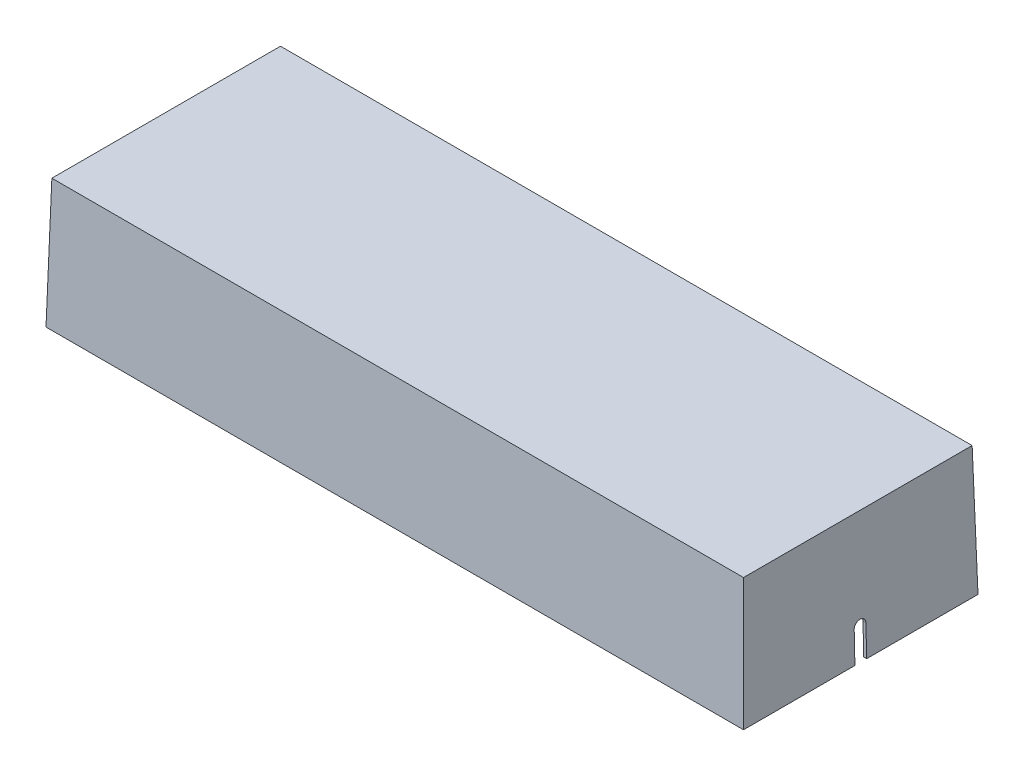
ISO-10303-21;
HEADER;
FILE_DESCRIPTION(('STEP AP214'),'2;1');
FILE_NAME('part.step','',(''),(''),'','','');
FILE_SCHEMA(('AUTOMOTIVE_DESIGN { 1 0 10303 214 1 1 1 1 }'));
ENDSEC;
DATA;
#1=APPLICATION_CONTEXT('core data for automotive mechanical design processes');
#2=APPLICATION_PROTOCOL_DEFINITION('international standard','automotive_design',2000,#1);
#3=PRODUCT_CONTEXT('',#1,'mechanical');
#4=PRODUCT('Part','Part','',(#3));
#5=PRODUCT_RELATED_PRODUCT_CATEGORY('part','',(#4));
#6=PRODUCT_DEFINITION_FORMATION('','',#4);
#7=PRODUCT_DEFINITION_CONTEXT('part definition',#1,'design');
#8=PRODUCT_DEFINITION('design','',#6,#7);
#9=PRODUCT_DEFINITION_SHAPE('','',#8);
#10=(LENGTH_UNIT() NAMED_UNIT(*) SI_UNIT(.MILLI.,.METRE.));
#11=(NAMED_UNIT(*) PLANE_ANGLE_UNIT() SI_UNIT($,.RADIAN.));
#12=(NAMED_UNIT(*) SI_UNIT($,.STERADIAN.) SOLID_ANGLE_UNIT());
#13=UNCERTAINTY_MEASURE_WITH_UNIT(LENGTH_MEASURE(1.E-05),#10,'distance_accuracy_value','');
#14=(GEOMETRIC_REPRESENTATION_CONTEXT(3) GLOBAL_UNCERTAINTY_ASSIGNED_CONTEXT((#13)) GLOBAL_UNIT_ASSIGNED_CONTEXT((#10,
#11,#12)) REPRESENTATION_CONTEXT('',''));
#15=CARTESIAN_POINT('',(0.,0.,0.));
#16=DIRECTION('',(0.,0.,1.));
#17=DIRECTION('',(1.,0.,0.));
#18=AXIS2_PLACEMENT_3D('',#15,#16,#17);
#19=CARTESIAN_POINT('',(-119.,0.,-40.));
#20=DIRECTION('',(-0.999742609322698,0.0226873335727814,0.));
#21=DIRECTION('',(-0.0226873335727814,-0.999742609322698,0.));
#22=AXIS2_PLACEMENT_3D('',#19,#20,#21);
#23=PLANE('',#22);
#24=DIRECTION('',(-0.0226873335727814,-0.999742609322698,0.));
#25=VECTOR('',#24,1.);
#26=CARTESIAN_POINT('',(-119.,0.,2.));
#27=LINE('',#26,#25);
#28=CARTESIAN_POINT('',(-119.,0.,2.));
#29=VERTEX_POINT('',#28);
#30=CARTESIAN_POINT('',(-118.761721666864,10.5,2.));
#31=VERTEX_POINT('',#30);
#32=EDGE_CURVE('E536',#29,#31,#27,.F.);
#33=ORIENTED_EDGE('',*,*,#32,.F.);
#34=DIRECTION('',(0.,0.,1.));
#35=VECTOR('',#34,1.);
#36=CARTESIAN_POINT('',(-119.,0.,-40.));
#37=LINE('',#36,#35);
#38=CARTESIAN_POINT('',(-119.,0.,40.));
#39=VERTEX_POINT('',#38);
#40=EDGE_CURVE('E907',#29,#39,#37,.T.);
#41=ORIENTED_EDGE('',*,*,#40,.T.);
#42=DIRECTION('',(-0.0226814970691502,-0.999485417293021,0.0226814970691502));
#43=VECTOR('',#42,1.);
#44=CARTESIAN_POINT('',(-119.,0.,40.));
#45=LINE('',#44,#43);
#46=CARTESIAN_POINT('',(-118.001500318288,44.,39.0015003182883));
#47=VERTEX_POINT('',#46);
#48=EDGE_CURVE('E477',#47,#39,#45,.T.);
#49=ORIENTED_EDGE('',*,*,#48,.F.);
#50=DIRECTION('',(0.,0.,-1.));
#51=VECTOR('',#50,1.);
#52=CARTESIAN_POINT('',(-118.001500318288,44.,-40.));
#53=LINE('',#52,#51);
#54=CARTESIAN_POINT('',(-118.001500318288,44.,-39.0015003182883));
#55=VERTEX_POINT('',#54);
#56=EDGE_CURVE('E467',#55,#47,#53,.F.);
#57=ORIENTED_EDGE('',*,*,#56,.F.);
#58=DIRECTION('',(-0.0226814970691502,-0.999485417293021,-0.0226814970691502));
#59=VECTOR('',#58,1.);
#60=CARTESIAN_POINT('',(-119.,0.,-40.));
#61=LINE('',#60,#59);
#62=CARTESIAN_POINT('',(-119.,0.,-40.));
#63=VERTEX_POINT('',#62);
#64=EDGE_CURVE('E468',#55,#63,#61,.T.);
#65=ORIENTED_EDGE('',*,*,#64,.T.);
#66=CARTESIAN_POINT('',(-119.,0.,-2.));
#67=VERTEX_POINT('',#66);
#68=EDGE_CURVE('E462',#63,#67,#37,.T.);
#69=ORIENTED_EDGE('',*,*,#68,.T.);
#70=DIRECTION('',(0.0226873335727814,0.999742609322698,0.));
#71=VECTOR('',#70,1.);
#72=CARTESIAN_POINT('',(-119.,0.,-2.));
#73=LINE('',#72,#71);
#74=CARTESIAN_POINT('',(-118.761721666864,10.5,-2.));
#75=VERTEX_POINT('',#74);
#76=EDGE_CURVE('E451',#75,#67,#73,.F.);
#77=ORIENTED_EDGE('',*,*,#76,.F.);
#78=CARTESIAN_POINT('',(-118.761721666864,10.5,0.));
#79=DIRECTION('',(-0.999742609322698,0.0226873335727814,0.));
#80=DIRECTION('',(-0.0226873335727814,-0.999742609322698,0.));
#81=AXIS2_PLACEMENT_3D('',#78,#79,#80);
#82=ELLIPSE('',#81,2.00051491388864,2.);
#83=EDGE_CURVE('E529',#31,#75,#82,.T.);
#84=ORIENTED_EDGE('',*,*,#83,.F.);
#85=EDGE_LOOP('',(#33,#41,#49,#57,#65,#69,#77,#84));
#86=FACE_BOUND('',#85,.T.);
#87=ADVANCED_FACE('F33',(#86),#23,.T.);
#88=CARTESIAN_POINT('',(119.,0.,-40.));
#89=DIRECTION('',(0.999742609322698,0.0226873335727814,0.));
#90=DIRECTION('',(-0.0226873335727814,0.999742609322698,0.));
#91=AXIS2_PLACEMENT_3D('',#88,#89,#90);
#92=PLANE('',#91);
#93=DIRECTION('',(-0.0226873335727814,0.999742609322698,0.));
#94=VECTOR('',#93,1.);
#95=CARTESIAN_POINT('',(119.,0.,2.));
#96=LINE('',#95,#94);
#97=CARTESIAN_POINT('',(118.761721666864,10.5,2.));
#98=VERTEX_POINT('',#97);
#99=CARTESIAN_POINT('',(119.,0.,2.));
#100=VERTEX_POINT('',#99);
#101=EDGE_CURVE('E534',#98,#100,#96,.F.);
#102=ORIENTED_EDGE('',*,*,#101,.F.);
#103=CARTESIAN_POINT('',(118.761721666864,10.5,0.));
#104=DIRECTION('',(0.999742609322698,0.0226873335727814,0.));
#105=DIRECTION('',(-0.0226873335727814,0.999742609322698,0.));
#106=AXIS2_PLACEMENT_3D('',#103,#104,#105);
#107=ELLIPSE('',#106,2.00051491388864,2.);
#108=CARTESIAN_POINT('',(118.761721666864,10.5,-2.));
#109=VERTEX_POINT('',#108);
#110=EDGE_CURVE('E450',#109,#98,#107,.T.);
#111=ORIENTED_EDGE('',*,*,#110,.F.);
#112=DIRECTION('',(0.0226873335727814,-0.999742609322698,0.));
#113=VECTOR('',#112,1.);
#114=CARTESIAN_POINT('',(119.,0.,-2.));
#115=LINE('',#114,#113);
#116=CARTESIAN_POINT('',(119.,0.,-2.));
#117=VERTEX_POINT('',#116);
#118=EDGE_CURVE('E435',#117,#109,#115,.F.);
#119=ORIENTED_EDGE('',*,*,#118,.F.);
#120=DIRECTION('',(0.,0.,-1.));
#121=VECTOR('',#120,1.);
#122=CARTESIAN_POINT('',(119.,0.,-40.));
#123=LINE('',#122,#121);
#124=CARTESIAN_POINT('',(119.,0.,-40.));
#125=VERTEX_POINT('',#124);
#126=EDGE_CURVE('E448',#117,#125,#123,.T.);
#127=ORIENTED_EDGE('',*,*,#126,.T.);
#128=DIRECTION('',(0.0226814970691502,-0.999485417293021,-0.0226814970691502));
#129=VECTOR('',#128,1.);
#130=CARTESIAN_POINT('',(118.877560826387,5.39541848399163,-39.8775608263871));
#131=LINE('',#130,#129);
#132=CARTESIAN_POINT('',(118.001500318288,44.,-39.0015003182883));
#133=VERTEX_POINT('',#132);
#134=EDGE_CURVE('E471',#133,#125,#131,.T.);
#135=ORIENTED_EDGE('',*,*,#134,.F.);
#136=DIRECTION('',(0.,0.,1.));
#137=VECTOR('',#136,1.);
#138=CARTESIAN_POINT('',(118.001500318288,44.,-40.));
#139=LINE('',#138,#137);
#140=CARTESIAN_POINT('',(118.001500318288,44.,39.0015003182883));
#141=VERTEX_POINT('',#140);
#142=EDGE_CURVE('E482',#141,#133,#139,.F.);
#143=ORIENTED_EDGE('',*,*,#142,.F.);
#144=DIRECTION('',(0.0226814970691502,-0.999485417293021,0.0226814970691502));
#145=VECTOR('',#144,1.);
#146=CARTESIAN_POINT('',(118.958843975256,1.8135860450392,39.9588439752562));
#147=LINE('',#146,#145);
#148=CARTESIAN_POINT('',(119.,0.,40.));
#149=VERTEX_POINT('',#148);
#150=EDGE_CURVE('E474',#141,#149,#147,.T.);
#151=ORIENTED_EDGE('',*,*,#150,.T.);
#152=EDGE_CURVE('E458',#149,#100,#123,.T.);
#153=ORIENTED_EDGE('',*,*,#152,.T.);
#154=EDGE_LOOP('',(#102,#111,#119,#127,#135,#143,#151,#153));
#155=FACE_BOUND('',#154,.T.);
#156=ADVANCED_FACE('F446',(#155),#92,.T.);
#157=CARTESIAN_POINT('',(-119.,0.,40.));
#158=DIRECTION('',(0.,1.,0.));
#159=DIRECTION('',(0.,0.,1.));
#160=AXIS2_PLACEMENT_3D('',#157,#158,#159);
#161=PLANE('',#160);
#162=DIRECTION('',(-1.,0.,0.));
#163=VECTOR('',#162,1.);
#164=CARTESIAN_POINT('',(363.63968679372,0.,2.));
#165=LINE('',#164,#163);
#166=CARTESIAN_POINT('',(117.999742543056,0.,2.));
#167=VERTEX_POINT('',#166);
#168=EDGE_CURVE('E518',#100,#167,#165,.T.);
#169=ORIENTED_EDGE('',*,*,#168,.F.);
#170=ORIENTED_EDGE('',*,*,#152,.F.);
#171=DIRECTION('',(1.,0.,0.));
#172=VECTOR('',#171,1.);
#173=CARTESIAN_POINT('',(-119.,0.,40.));
#174=LINE('',#173,#172);
#175=EDGE_CURVE('E459',#39,#149,#174,.T.);
#176=ORIENTED_EDGE('',*,*,#175,.F.);
#177=ORIENTED_EDGE('',*,*,#40,.F.);
#178=CARTESIAN_POINT('',(-117.999742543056,0.,2.));
#179=VERTEX_POINT('',#178);
#180=EDGE_CURVE('E515',#179,#29,#165,.T.);
#181=ORIENTED_EDGE('',*,*,#180,.F.);
#182=DIRECTION('',(0.,0.,-1.));
#183=VECTOR('',#182,1.);
#184=CARTESIAN_POINT('',(-117.999742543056,0.,-40.));
#185=LINE('',#184,#183);
#186=CARTESIAN_POINT('',(-117.999742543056,0.,38.9997425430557));
#187=VERTEX_POINT('',#186);
#188=EDGE_CURVE('E903',#179,#187,#185,.F.);
#189=ORIENTED_EDGE('',*,*,#188,.T.);
#190=DIRECTION('',(-1.,0.,0.));
#191=VECTOR('',#190,1.);
#192=CARTESIAN_POINT('',(-119.,0.,38.9997425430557));
#193=LINE('',#192,#191);
#194=CARTESIAN_POINT('',(117.999742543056,0.,38.9997425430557));
#195=VERTEX_POINT('',#194);
#196=EDGE_CURVE('E937',#187,#195,#193,.F.);
#197=ORIENTED_EDGE('',*,*,#196,.T.);
#198=DIRECTION('',(0.,0.,1.));
#199=VECTOR('',#198,1.);
#200=CARTESIAN_POINT('',(117.999742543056,0.,-40.));
#201=LINE('',#200,#199);
#202=EDGE_CURVE('E940',#195,#167,#201,.F.);
#203=ORIENTED_EDGE('',*,*,#202,.T.);
#204=EDGE_LOOP('',(#169,#170,#176,#177,#181,#189,#197,#203));
#205=FACE_BOUND('',#204,.T.);
#206=ADVANCED_FACE('F957',(#205),#161,.F.);
#207=DIRECTION('',(-1.,0.,0.));
#208=VECTOR('',#207,1.);
#209=CARTESIAN_POINT('',(363.63968679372,0.,-2.));
#210=LINE('',#209,#208);
#211=CARTESIAN_POINT('',(-117.999742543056,0.,-2.));
#212=VERTEX_POINT('',#211);
#213=EDGE_CURVE('E48',#212,#67,#210,.T.);
#214=ORIENTED_EDGE('',*,*,#213,.T.);
#215=ORIENTED_EDGE('',*,*,#68,.F.);
#216=DIRECTION('',(-1.,0.,0.));
#217=VECTOR('',#216,1.);
#218=CARTESIAN_POINT('',(-119.,0.,-40.));
#219=LINE('',#218,#217);
#220=EDGE_CURVE('E457',#125,#63,#219,.T.);
#221=ORIENTED_EDGE('',*,*,#220,.F.);
#222=ORIENTED_EDGE('',*,*,#126,.F.);
#223=CARTESIAN_POINT('',(117.999742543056,0.,-2.));
#224=VERTEX_POINT('',#223);
#225=EDGE_CURVE('E432',#117,#224,#210,.T.);
#226=ORIENTED_EDGE('',*,*,#225,.T.);
#227=CARTESIAN_POINT('',(117.999742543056,0.,-38.9997425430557));
#228=VERTEX_POINT('',#227);
#229=EDGE_CURVE('E942',#224,#228,#201,.F.);
#230=ORIENTED_EDGE('',*,*,#229,.T.);
#231=DIRECTION('',(1.,0.,0.));
#232=VECTOR('',#231,1.);
#233=CARTESIAN_POINT('',(-119.,0.,-38.9997425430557));
#234=LINE('',#233,#232);
#235=CARTESIAN_POINT('',(-117.999742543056,0.,-38.9997425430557));
#236=VERTEX_POINT('',#235);
#237=EDGE_CURVE('E913',#228,#236,#234,.F.);
#238=ORIENTED_EDGE('',*,*,#237,.T.);
#239=EDGE_CURVE('E934',#236,#212,#185,.F.);
#240=ORIENTED_EDGE('',*,*,#239,.T.);
#241=EDGE_LOOP('',(#214,#215,#221,#222,#226,#230,#238,#240));
#242=FACE_BOUND('',#241,.T.);
#243=ADVANCED_FACE('F455',(#242),#161,.F.);
#244=CARTESIAN_POINT('',(-118.000257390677,-0.0226873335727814,-40.));
#245=DIRECTION('',(-0.999742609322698,0.0226873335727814,0.));
#246=DIRECTION('',(-0.0226873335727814,-0.999742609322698,0.));
#247=AXIS2_PLACEMENT_3D('',#244,#245,#246);
#248=PLANE('',#247);
#249=ORIENTED_EDGE('',*,*,#188,.F.);
#250=DIRECTION('',(-0.0226873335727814,-0.999742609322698,0.));
#251=VECTOR('',#250,1.);
#252=CARTESIAN_POINT('',(-118.000257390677,-0.0226873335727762,2.));
#253=LINE('',#252,#251);
#254=CARTESIAN_POINT('',(-117.76146420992,10.5,2.));
#255=VERTEX_POINT('',#254);
#256=EDGE_CURVE('E531',#179,#255,#253,.F.);
#257=ORIENTED_EDGE('',*,*,#256,.T.);
#258=CARTESIAN_POINT('',(-117.76146420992,10.5,0.));
#259=DIRECTION('',(-0.999742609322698,0.0226873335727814,0.));
#260=DIRECTION('',(-0.0226873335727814,-0.999742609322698,0.));
#261=AXIS2_PLACEMENT_3D('',#258,#259,#260);
#262=ELLIPSE('',#261,2.00051491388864,2.);
#263=CARTESIAN_POINT('',(-117.76146420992,10.5,-2.));
#264=VERTEX_POINT('',#263);
#265=EDGE_CURVE('E525',#255,#264,#262,.T.);
#266=ORIENTED_EDGE('',*,*,#265,.T.);
#267=DIRECTION('',(0.0226873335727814,0.999742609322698,0.));
#268=VECTOR('',#267,1.);
#269=CARTESIAN_POINT('',(-118.000257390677,-0.0226873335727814,-2.));
#270=LINE('',#269,#268);
#271=EDGE_CURVE('E452',#264,#212,#270,.F.);
#272=ORIENTED_EDGE('',*,*,#271,.T.);
#273=ORIENTED_EDGE('',*,*,#239,.F.);
#274=DIRECTION('',(-0.0226814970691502,-0.999485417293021,-0.0226814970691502));
#275=VECTOR('',#274,1.);
#276=CARTESIAN_POINT('',(-118.000771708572,-0.0453513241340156,-39.0007717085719));
#277=LINE('',#276,#275);
#278=CARTESIAN_POINT('',(-117.023936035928,43.,-38.0239360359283));
#279=VERTEX_POINT('',#278);
#280=EDGE_CURVE('E914',#279,#236,#277,.T.);
#281=ORIENTED_EDGE('',*,*,#280,.F.);
#282=DIRECTION('',(0.,0.,-1.));
#283=VECTOR('',#282,1.);
#284=CARTESIAN_POINT('',(-117.023936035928,43.,-40.));
#285=LINE('',#284,#283);
#286=CARTESIAN_POINT('',(-117.023936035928,43.,38.0239360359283));
#287=VERTEX_POINT('',#286);
#288=EDGE_CURVE('E909',#279,#287,#285,.F.);
#289=ORIENTED_EDGE('',*,*,#288,.T.);
#290=DIRECTION('',(-0.0226814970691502,-0.999485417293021,0.0226814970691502));
#291=VECTOR('',#290,1.);
#292=CARTESIAN_POINT('',(-118.000771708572,-0.0453513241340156,39.0007717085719));
#293=LINE('',#292,#291);
#294=EDGE_CURVE('E904',#287,#187,#293,.T.);
#295=ORIENTED_EDGE('',*,*,#294,.T.);
#296=EDGE_LOOP('',(#249,#257,#266,#272,#273,#281,#289,#295));
#297=FACE_BOUND('',#296,.T.);
#298=ADVANCED_FACE('F971',(#297),#248,.F.);
#299=CARTESIAN_POINT('',(118.000257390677,-0.0226873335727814,-40.));
#300=DIRECTION('',(0.999742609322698,0.0226873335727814,0.));
#301=DIRECTION('',(-0.0226873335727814,0.999742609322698,0.));
#302=AXIS2_PLACEMENT_3D('',#299,#300,#301);
#303=PLANE('',#302);
#304=CARTESIAN_POINT('',(117.76146420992,10.5,0.));
#305=DIRECTION('',(0.999742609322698,0.0226873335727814,0.));
#306=DIRECTION('',(-0.0226873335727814,0.999742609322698,0.));
#307=AXIS2_PLACEMENT_3D('',#304,#305,#306);
#308=ELLIPSE('',#307,2.00051491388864,2.);
#309=CARTESIAN_POINT('',(117.76146420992,10.5,-2.));
#310=VERTEX_POINT('',#309);
#311=CARTESIAN_POINT('',(117.76146420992,10.5,2.));
#312=VERTEX_POINT('',#311);
#313=EDGE_CURVE('E41',#310,#312,#308,.T.);
#314=ORIENTED_EDGE('',*,*,#313,.T.);
#315=DIRECTION('',(-0.0226873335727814,0.999742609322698,0.));
#316=VECTOR('',#315,1.);
#317=CARTESIAN_POINT('',(118.000257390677,-0.022687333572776,2.));
#318=LINE('',#317,#316);
#319=EDGE_CURVE('E11',#312,#167,#318,.F.);
#320=ORIENTED_EDGE('',*,*,#319,.T.);
#321=ORIENTED_EDGE('',*,*,#202,.F.);
#322=DIRECTION('',(0.0226814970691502,-0.999485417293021,0.0226814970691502));
#323=VECTOR('',#322,1.);
#324=CARTESIAN_POINT('',(117.959615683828,1.76823472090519,38.959615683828));
#325=LINE('',#324,#323);
#326=CARTESIAN_POINT('',(117.023936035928,43.,38.0239360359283));
#327=VERTEX_POINT('',#326);
#328=EDGE_CURVE('E908',#327,#195,#325,.T.);
#329=ORIENTED_EDGE('',*,*,#328,.F.);
#330=DIRECTION('',(0.,0.,1.));
#331=VECTOR('',#330,1.);
#332=CARTESIAN_POINT('',(117.023936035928,43.,-40.));
#333=LINE('',#332,#331);
#334=CARTESIAN_POINT('',(117.023936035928,43.,-38.0239360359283));
#335=VERTEX_POINT('',#334);
#336=EDGE_CURVE('E923',#327,#335,#333,.F.);
#337=ORIENTED_EDGE('',*,*,#336,.T.);
#338=DIRECTION('',(0.0226814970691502,-0.999485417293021,-0.0226814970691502));
#339=VECTOR('',#338,1.);
#340=CARTESIAN_POINT('',(117.878332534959,5.35006715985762,-38.878332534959));
#341=LINE('',#340,#339);
#342=EDGE_CURVE('E916',#335,#228,#341,.T.);
#343=ORIENTED_EDGE('',*,*,#342,.T.);
#344=ORIENTED_EDGE('',*,*,#229,.F.);
#345=DIRECTION('',(0.0226873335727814,-0.999742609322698,0.));
#346=VECTOR('',#345,1.);
#347=CARTESIAN_POINT('',(118.000257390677,-0.0226873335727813,-2.));
#348=LINE('',#347,#346);
#349=EDGE_CURVE('E437',#224,#310,#348,.F.);
#350=ORIENTED_EDGE('',*,*,#349,.T.);
#351=EDGE_LOOP('',(#314,#320,#321,#329,#337,#343,#344,#350));
#352=FACE_BOUND('',#351,.T.);
#353=ADVANCED_FACE('F507',(#352),#303,.F.);
#354=CARTESIAN_POINT('',(-36.,41.,38.0239360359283));
#355=DIRECTION('',(0.,1.,0.));
#356=DIRECTION('',(0.,0.,1.));
#357=AXIS2_PLACEMENT_3D('',#354,#355,#356);
#358=PLANE('',#357);
#359=DIRECTION('',(1.,0.,0.));
#360=VECTOR('',#359,1.);
#361=CARTESIAN_POINT('',(-36.,41.,35.0239360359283));
#362=LINE('',#361,#360);
#363=CARTESIAN_POINT('',(-36.,41.,35.0239360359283));
#364=VERTEX_POINT('',#363);
#365=CARTESIAN_POINT('',(-34.5,41.,35.0239360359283));
#366=VERTEX_POINT('',#365);
#367=EDGE_CURVE('E555',#364,#366,#362,.T.);
#368=ORIENTED_EDGE('',*,*,#367,.F.);
#369=DIRECTION('',(0.,0.,-1.));
#370=VECTOR('',#369,1.);
#371=CARTESIAN_POINT('',(-36.,41.,-38.0239360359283));
#372=LINE('',#371,#370);
#373=CARTESIAN_POINT('',(-36.,41.,-35.0239360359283));
#374=VERTEX_POINT('',#373);
#375=EDGE_CURVE('E762',#364,#374,#372,.T.);
#376=ORIENTED_EDGE('',*,*,#375,.T.);
#377=DIRECTION('',(-1.,0.,0.));
#378=VECTOR('',#377,1.);
#379=CARTESIAN_POINT('',(-36.,41.,-35.0239360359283));
#380=LINE('',#379,#378);
#381=CARTESIAN_POINT('',(-34.5,41.,-35.0239360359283));
#382=VERTEX_POINT('',#381);
#383=EDGE_CURVE('E502',#382,#374,#380,.T.);
#384=ORIENTED_EDGE('',*,*,#383,.F.);
#385=DIRECTION('',(0.,0.,1.));
#386=VECTOR('',#385,1.);
#387=CARTESIAN_POINT('',(-34.5,41.,38.0239360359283));
#388=LINE('',#387,#386);
#389=EDGE_CURVE('E764',#382,#366,#388,.T.);
#390=ORIENTED_EDGE('',*,*,#389,.T.);
#391=EDGE_LOOP('',(#368,#376,#384,#390));
#392=FACE_BOUND('',#391,.T.);
#393=ADVANCED_FACE('F1190',(#392),#358,.F.);
#394=CARTESIAN_POINT('',(-32.5,41.,38.0239360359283));
#395=DIRECTION('',(0.,1.,0.));
#396=DIRECTION('',(0.,0.,1.));
#397=AXIS2_PLACEMENT_3D('',#394,#395,#396);
#398=PLANE('',#397);
#399=DIRECTION('',(1.,0.,0.));
#400=VECTOR('',#399,1.);
#401=CARTESIAN_POINT('',(-32.5,41.,35.0239360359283));
#402=LINE('',#401,#400);
#403=CARTESIAN_POINT('',(-32.5,41.,35.0239360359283));
#404=VERTEX_POINT('',#403);
#405=CARTESIAN_POINT('',(-31.,41.,35.0239360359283));
#406=VERTEX_POINT('',#405);
#407=EDGE_CURVE('E575',#404,#406,#402,.T.);
#408=ORIENTED_EDGE('',*,*,#407,.F.);
#409=DIRECTION('',(0.,0.,-1.));
#410=VECTOR('',#409,1.);
#411=CARTESIAN_POINT('',(-32.5,41.,-38.0239360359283));
#412=LINE('',#411,#410);
#413=CARTESIAN_POINT('',(-32.5,41.,-35.0239360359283));
#414=VERTEX_POINT('',#413);
#415=EDGE_CURVE('E787',#404,#414,#412,.T.);
#416=ORIENTED_EDGE('',*,*,#415,.T.);
#417=DIRECTION('',(-1.,0.,0.));
#418=VECTOR('',#417,1.);
#419=CARTESIAN_POINT('',(-32.5,41.,-35.0239360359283));
#420=LINE('',#419,#418);
#421=CARTESIAN_POINT('',(-31.,41.,-35.0239360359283));
#422=VERTEX_POINT('',#421);
#423=EDGE_CURVE('E496',#422,#414,#420,.T.);
#424=ORIENTED_EDGE('',*,*,#423,.F.);
#425=DIRECTION('',(0.,0.,1.));
#426=VECTOR('',#425,1.);
#427=CARTESIAN_POINT('',(-31.,41.,38.0239360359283));
#428=LINE('',#427,#426);
#429=EDGE_CURVE('E789',#422,#406,#428,.T.);
#430=ORIENTED_EDGE('',*,*,#429,.T.);
#431=EDGE_LOOP('',(#408,#416,#424,#430));
#432=FACE_BOUND('',#431,.T.);
#433=ADVANCED_FACE('F1167',(#432),#398,.F.);
#434=CARTESIAN_POINT('',(-27.5,41.,-38.0239360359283));
#435=DIRECTION('',(0.,1.,0.));
#436=DIRECTION('',(0.,0.,1.));
#437=AXIS2_PLACEMENT_3D('',#434,#435,#436);
#438=PLANE('',#437);
#439=DIRECTION('',(1.,0.,0.));
#440=VECTOR('',#439,1.);
#441=CARTESIAN_POINT('',(-27.5,41.,35.0239360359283));
#442=LINE('',#441,#440);
#443=CARTESIAN_POINT('',(-29.,41.,35.0239360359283));
#444=VERTEX_POINT('',#443);
#445=CARTESIAN_POINT('',(-27.5,41.,35.0239360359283));
#446=VERTEX_POINT('',#445);
#447=EDGE_CURVE('E595',#444,#446,#442,.T.);
#448=ORIENTED_EDGE('',*,*,#447,.F.);
#449=DIRECTION('',(0.,0.,-1.));
#450=VECTOR('',#449,1.);
#451=CARTESIAN_POINT('',(-29.,41.,-38.0239360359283));
#452=LINE('',#451,#450);
#453=CARTESIAN_POINT('',(-29.,41.,-35.0239360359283));
#454=VERTEX_POINT('',#453);
#455=EDGE_CURVE('E863',#444,#454,#452,.T.);
#456=ORIENTED_EDGE('',*,*,#455,.T.);
#457=DIRECTION('',(-1.,0.,0.));
#458=VECTOR('',#457,1.);
#459=CARTESIAN_POINT('',(-27.5,41.,-35.0239360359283));
#460=LINE('',#459,#458);
#461=CARTESIAN_POINT('',(-27.5,41.,-35.0239360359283));
#462=VERTEX_POINT('',#461);
#463=EDGE_CURVE('E493',#462,#454,#460,.T.);
#464=ORIENTED_EDGE('',*,*,#463,.F.);
#465=DIRECTION('',(0.,0.,1.));
#466=VECTOR('',#465,1.);
#467=CARTESIAN_POINT('',(-27.5,41.,38.0239360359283));
#468=LINE('',#467,#466);
#469=EDGE_CURVE('E861',#462,#446,#468,.T.);
#470=ORIENTED_EDGE('',*,*,#469,.T.);
#471=EDGE_LOOP('',(#448,#456,#464,#470));
#472=FACE_BOUND('',#471,.T.);
#473=ADVANCED_FACE('F1158',(#472),#438,.F.);
#474=CARTESIAN_POINT('',(29.,41.,38.0239360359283));
#475=DIRECTION('',(0.,1.,0.));
#476=DIRECTION('',(0.,0.,1.));
#477=AXIS2_PLACEMENT_3D('',#474,#475,#476);
#478=PLANE('',#477);
#479=DIRECTION('',(1.,0.,0.));
#480=VECTOR('',#479,1.);
#481=CARTESIAN_POINT('',(29.,41.,35.0239360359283));
#482=LINE('',#481,#480);
#483=CARTESIAN_POINT('',(27.5,41.,35.0239360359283));
#484=VERTEX_POINT('',#483);
#485=CARTESIAN_POINT('',(29.,41.,35.0239360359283));
#486=VERTEX_POINT('',#485);
#487=EDGE_CURVE('E614',#484,#486,#482,.T.);
#488=ORIENTED_EDGE('',*,*,#487,.F.);
#489=DIRECTION('',(0.,0.,-1.));
#490=VECTOR('',#489,1.);
#491=CARTESIAN_POINT('',(27.5,41.,38.0239360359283));
#492=LINE('',#491,#490);
#493=CARTESIAN_POINT('',(27.5,41.,-35.0239360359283));
#494=VERTEX_POINT('',#493);
#495=EDGE_CURVE('E887',#484,#494,#492,.T.);
#496=ORIENTED_EDGE('',*,*,#495,.T.);
#497=DIRECTION('',(-1.,0.,0.));
#498=VECTOR('',#497,1.);
#499=CARTESIAN_POINT('',(29.,41.,-35.0239360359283));
#500=LINE('',#499,#498);
#501=CARTESIAN_POINT('',(29.,41.,-35.0239360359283));
#502=VERTEX_POINT('',#501);
#503=EDGE_CURVE('E490',#502,#494,#500,.T.);
#504=ORIENTED_EDGE('',*,*,#503,.F.);
#505=DIRECTION('',(0.,0.,1.));
#506=VECTOR('',#505,1.);
#507=CARTESIAN_POINT('',(29.,41.,-38.0239360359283));
#508=LINE('',#507,#506);
#509=EDGE_CURVE('E889',#502,#486,#508,.T.);
#510=ORIENTED_EDGE('',*,*,#509,.T.);
#511=EDGE_LOOP('',(#488,#496,#504,#510));
#512=FACE_BOUND('',#511,.T.);
#513=ADVANCED_FACE('F1155',(#512),#478,.F.);
#514=CARTESIAN_POINT('',(32.5,41.,38.0239360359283));
#515=DIRECTION('',(0.,1.,0.));
#516=DIRECTION('',(0.,0.,1.));
#517=AXIS2_PLACEMENT_3D('',#514,#515,#516);
#518=PLANE('',#517);
#519=DIRECTION('',(1.,0.,0.));
#520=VECTOR('',#519,1.);
#521=CARTESIAN_POINT('',(32.5,41.,35.0239360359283));
#522=LINE('',#521,#520);
#523=CARTESIAN_POINT('',(31.,41.,35.0239360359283));
#524=VERTEX_POINT('',#523);
#525=CARTESIAN_POINT('',(32.5,41.,35.0239360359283));
#526=VERTEX_POINT('',#525);
#527=EDGE_CURVE('E633',#524,#526,#522,.T.);
#528=ORIENTED_EDGE('',*,*,#527,.F.);
#529=DIRECTION('',(0.,0.,-1.));
#530=VECTOR('',#529,1.);
#531=CARTESIAN_POINT('',(31.,41.,38.0239360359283));
#532=LINE('',#531,#530);
#533=CARTESIAN_POINT('',(31.,41.,-35.0239360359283));
#534=VERTEX_POINT('',#533);
#535=EDGE_CURVE('E837',#524,#534,#532,.T.);
#536=ORIENTED_EDGE('',*,*,#535,.T.);
#537=DIRECTION('',(-1.,0.,0.));
#538=VECTOR('',#537,1.);
#539=CARTESIAN_POINT('',(32.5,41.,-35.0239360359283));
#540=LINE('',#539,#538);
#541=CARTESIAN_POINT('',(32.5,41.,-35.0239360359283));
#542=VERTEX_POINT('',#541);
#543=EDGE_CURVE('E480',#542,#534,#540,.T.);
#544=ORIENTED_EDGE('',*,*,#543,.F.);
#545=DIRECTION('',(0.,0.,1.));
#546=VECTOR('',#545,1.);
#547=CARTESIAN_POINT('',(32.5,41.,-38.0239360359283));
#548=LINE('',#547,#546);
#549=EDGE_CURVE('E839',#542,#526,#548,.T.);
#550=ORIENTED_EDGE('',*,*,#549,.T.);
#551=EDGE_LOOP('',(#528,#536,#544,#550));
#552=FACE_BOUND('',#551,.T.);
#553=ADVANCED_FACE('F1157',(#552),#518,.F.);
#554=CARTESIAN_POINT('',(36.,41.,38.0239360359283));
#555=DIRECTION('',(0.,1.,0.));
#556=DIRECTION('',(0.,0.,1.));
#557=AXIS2_PLACEMENT_3D('',#554,#555,#556);
#558=PLANE('',#557);
#559=DIRECTION('',(1.,0.,0.));
#560=VECTOR('',#559,1.);
#561=CARTESIAN_POINT('',(36.,41.,35.0239360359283));
#562=LINE('',#561,#560);
#563=CARTESIAN_POINT('',(34.5,41.,35.0239360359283));
#564=VERTEX_POINT('',#563);
#565=CARTESIAN_POINT('',(36.,41.,35.0239360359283));
#566=VERTEX_POINT('',#565);
#567=EDGE_CURVE('E652',#564,#566,#562,.T.);
#568=ORIENTED_EDGE('',*,*,#567,.F.);
#569=DIRECTION('',(0.,0.,-1.));
#570=VECTOR('',#569,1.);
#571=CARTESIAN_POINT('',(34.5,41.,38.0239360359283));
#572=LINE('',#571,#570);
#573=CARTESIAN_POINT('',(34.5,41.,-35.0239360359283));
#574=VERTEX_POINT('',#573);
#575=EDGE_CURVE('E812',#564,#574,#572,.T.);
#576=ORIENTED_EDGE('',*,*,#575,.T.);
#577=DIRECTION('',(-1.,0.,0.));
#578=VECTOR('',#577,1.);
#579=CARTESIAN_POINT('',(36.,41.,-35.0239360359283));
#580=LINE('',#579,#578);
#581=CARTESIAN_POINT('',(36.,41.,-35.0239360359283));
#582=VERTEX_POINT('',#581);
#583=EDGE_CURVE('E499',#582,#574,#580,.T.);
#584=ORIENTED_EDGE('',*,*,#583,.F.);
#585=DIRECTION('',(0.,0.,1.));
#586=VECTOR('',#585,1.);
#587=CARTESIAN_POINT('',(36.,41.,-38.0239360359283));
#588=LINE('',#587,#586);
#589=EDGE_CURVE('E814',#582,#566,#588,.T.);
#590=ORIENTED_EDGE('',*,*,#589,.T.);
#591=EDGE_LOOP('',(#568,#576,#584,#590));
#592=FACE_BOUND('',#591,.T.);
#593=ADVANCED_FACE('F1164',(#592),#558,.F.);
#594=CARTESIAN_POINT('',(-119.,43.,40.));
#595=DIRECTION('',(0.,1.,0.));
#596=DIRECTION('',(0.,0.,1.));
#597=AXIS2_PLACEMENT_3D('',#594,#595,#596);
#598=PLANE('',#597);
#599=DIRECTION('',(0.,0.,-1.));
#600=VECTOR('',#599,1.);
#601=CARTESIAN_POINT('',(-36.,43.,-38.0239360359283));
#602=LINE('',#601,#600);
#603=CARTESIAN_POINT('',(-36.,43.,38.0239360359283));
#604=VERTEX_POINT('',#603);
#605=CARTESIAN_POINT('',(-36.,43.,-38.0239360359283));
#606=VERTEX_POINT('',#605);
#607=EDGE_CURVE('E754',#604,#606,#602,.T.);
#608=ORIENTED_EDGE('',*,*,#607,.F.);
#609=DIRECTION('',(-1.,0.,0.));
#610=VECTOR('',#609,1.);
#611=CARTESIAN_POINT('',(-119.,43.,38.0239360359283));
#612=LINE('',#611,#610);
#613=EDGE_CURVE('E920',#287,#604,#612,.F.);
#614=ORIENTED_EDGE('',*,*,#613,.F.);
#615=ORIENTED_EDGE('',*,*,#288,.F.);
#616=DIRECTION('',(1.,0.,0.));
#617=VECTOR('',#616,1.);
#618=CARTESIAN_POINT('',(-119.,43.,-38.0239360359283));
#619=LINE('',#618,#617);
#620=EDGE_CURVE('E929',#606,#279,#619,.F.);
#621=ORIENTED_EDGE('',*,*,#620,.F.);
#622=EDGE_LOOP('',(#608,#614,#615,#621));
#623=FACE_BOUND('',#622,.T.);
#624=ADVANCED_FACE('F1108',(#623),#598,.F.);
#625=DIRECTION('',(0.,0.,1.));
#626=VECTOR('',#625,1.);
#627=CARTESIAN_POINT('',(-34.5,43.,38.0239360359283));
#628=LINE('',#627,#626);
#629=CARTESIAN_POINT('',(-34.5,43.,-38.0239360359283));
#630=VERTEX_POINT('',#629);
#631=CARTESIAN_POINT('',(-34.5,43.,38.0239360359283));
#632=VERTEX_POINT('',#631);
#633=EDGE_CURVE('E758',#630,#632,#628,.T.);
#634=ORIENTED_EDGE('',*,*,#633,.F.);
#635=CARTESIAN_POINT('',(-32.5,43.,-38.0239360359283));
#636=VERTEX_POINT('',#635);
#637=EDGE_CURVE('E1002',#636,#630,#619,.F.);
#638=ORIENTED_EDGE('',*,*,#637,.F.);
#639=DIRECTION('',(0.,0.,-1.));
#640=VECTOR('',#639,1.);
#641=CARTESIAN_POINT('',(-32.5,43.,-38.0239360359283));
#642=LINE('',#641,#640);
#643=CARTESIAN_POINT('',(-32.5,43.,38.0239360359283));
#644=VERTEX_POINT('',#643);
#645=EDGE_CURVE('E778',#644,#636,#642,.T.);
#646=ORIENTED_EDGE('',*,*,#645,.F.);
#647=EDGE_CURVE('E924',#632,#644,#612,.F.);
#648=ORIENTED_EDGE('',*,*,#647,.F.);
#649=EDGE_LOOP('',(#634,#638,#646,#648));
#650=FACE_BOUND('',#649,.T.);
#651=ADVANCED_FACE('F1077',(#650),#598,.F.);
#652=DIRECTION('',(0.,0.,1.));
#653=VECTOR('',#652,1.);
#654=CARTESIAN_POINT('',(-31.,43.,38.0239360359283));
#655=LINE('',#654,#653);
#656=CARTESIAN_POINT('',(-31.,43.,-38.0239360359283));
#657=VERTEX_POINT('',#656);
#658=CARTESIAN_POINT('',(-31.,43.,38.0239360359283));
#659=VERTEX_POINT('',#658);
#660=EDGE_CURVE('E782',#657,#659,#655,.T.);
#661=ORIENTED_EDGE('',*,*,#660,.F.);
#662=CARTESIAN_POINT('',(-29.,43.,-38.0239360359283));
#663=VERTEX_POINT('',#662);
#664=EDGE_CURVE('E1003',#663,#657,#619,.F.);
#665=ORIENTED_EDGE('',*,*,#664,.F.);
#666=DIRECTION('',(0.,0.,-1.));
#667=VECTOR('',#666,1.);
#668=CARTESIAN_POINT('',(-29.,43.,-38.0239360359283));
#669=LINE('',#668,#667);
#670=CARTESIAN_POINT('',(-29.,43.,38.0239360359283));
#671=VERTEX_POINT('',#670);
#672=EDGE_CURVE('E857',#671,#663,#669,.T.);
#673=ORIENTED_EDGE('',*,*,#672,.F.);
#674=EDGE_CURVE('E1110',#659,#671,#612,.F.);
#675=ORIENTED_EDGE('',*,*,#674,.F.);
#676=EDGE_LOOP('',(#661,#665,#673,#675));
#677=FACE_BOUND('',#676,.T.);
#678=ADVANCED_FACE('F1056',(#677),#598,.F.);
#679=DIRECTION('',(0.,0.,-1.));
#680=VECTOR('',#679,1.);
#681=CARTESIAN_POINT('',(34.5,43.,38.0239360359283));
#682=LINE('',#681,#680);
#683=CARTESIAN_POINT('',(34.5,43.,38.0239360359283));
#684=VERTEX_POINT('',#683);
#685=CARTESIAN_POINT('',(34.5,43.,-38.0239360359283));
#686=VERTEX_POINT('',#685);
#687=EDGE_CURVE('E806',#684,#686,#682,.T.);
#688=ORIENTED_EDGE('',*,*,#687,.F.);
#689=CARTESIAN_POINT('',(32.5,43.,38.0239360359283));
#690=VERTEX_POINT('',#689);
#691=EDGE_CURVE('E1114',#690,#684,#612,.F.);
#692=ORIENTED_EDGE('',*,*,#691,.F.);
#693=DIRECTION('',(0.,0.,1.));
#694=VECTOR('',#693,1.);
#695=CARTESIAN_POINT('',(32.5,43.,-38.0239360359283));
#696=LINE('',#695,#694);
#697=CARTESIAN_POINT('',(32.5,43.,-38.0239360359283));
#698=VERTEX_POINT('',#697);
#699=EDGE_CURVE('E835',#698,#690,#696,.T.);
#700=ORIENTED_EDGE('',*,*,#699,.F.);
#701=EDGE_CURVE('E932',#686,#698,#619,.F.);
#702=ORIENTED_EDGE('',*,*,#701,.F.);
#703=EDGE_LOOP('',(#688,#692,#700,#702));
#704=FACE_BOUND('',#703,.T.);
#705=ADVANCED_FACE('F1814',(#704),#598,.F.);
#706=DIRECTION('',(0.,0.,1.));
#707=VECTOR('',#706,1.);
#708=CARTESIAN_POINT('',(36.,43.,-38.0239360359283));
#709=LINE('',#708,#707);
#710=CARTESIAN_POINT('',(36.,43.,-38.0239360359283));
#711=VERTEX_POINT('',#710);
#712=CARTESIAN_POINT('',(36.,43.,38.0239360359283));
#713=VERTEX_POINT('',#712);
#714=EDGE_CURVE('E810',#711,#713,#709,.T.);
#715=ORIENTED_EDGE('',*,*,#714,.F.);
#716=EDGE_CURVE('E917',#335,#711,#619,.F.);
#717=ORIENTED_EDGE('',*,*,#716,.F.);
#718=ORIENTED_EDGE('',*,*,#336,.F.);
#719=EDGE_CURVE('E912',#713,#327,#612,.F.);
#720=ORIENTED_EDGE('',*,*,#719,.F.);
#721=EDGE_LOOP('',(#715,#717,#718,#720));
#722=FACE_BOUND('',#721,.T.);
#723=ADVANCED_FACE('F993',(#722),#598,.F.);
#724=DIRECTION('',(0.,0.,-1.));
#725=VECTOR('',#724,1.);
#726=CARTESIAN_POINT('',(31.,43.,38.0239360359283));
#727=LINE('',#726,#725);
#728=CARTESIAN_POINT('',(31.,43.,38.0239360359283));
#729=VERTEX_POINT('',#728);
#730=CARTESIAN_POINT('',(31.,43.,-38.0239360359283));
#731=VERTEX_POINT('',#730);
#732=EDGE_CURVE('E830',#729,#731,#727,.T.);
#733=ORIENTED_EDGE('',*,*,#732,.F.);
#734=CARTESIAN_POINT('',(29.,43.,38.0239360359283));
#735=VERTEX_POINT('',#734);
#736=EDGE_CURVE('E925',#735,#729,#612,.F.);
#737=ORIENTED_EDGE('',*,*,#736,.F.);
#738=DIRECTION('',(0.,0.,1.));
#739=VECTOR('',#738,1.);
#740=CARTESIAN_POINT('',(29.,43.,-38.0239360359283));
#741=LINE('',#740,#739);
#742=CARTESIAN_POINT('',(29.,43.,-38.0239360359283));
#743=VERTEX_POINT('',#742);
#744=EDGE_CURVE('E885',#743,#735,#741,.T.);
#745=ORIENTED_EDGE('',*,*,#744,.F.);
#746=EDGE_CURVE('E1007',#731,#743,#619,.F.);
#747=ORIENTED_EDGE('',*,*,#746,.F.);
#748=EDGE_LOOP('',(#733,#737,#745,#747));
#749=FACE_BOUND('',#748,.T.);
#750=ADVANCED_FACE('F1123',(#749),#598,.F.);
#751=DIRECTION('',(0.,0.,1.));
#752=VECTOR('',#751,1.);
#753=CARTESIAN_POINT('',(-27.5,43.,38.0239360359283));
#754=LINE('',#753,#752);
#755=CARTESIAN_POINT('',(-27.5,43.,-38.0239360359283));
#756=VERTEX_POINT('',#755);
#757=CARTESIAN_POINT('',(-27.5,43.,38.0239360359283));
#758=VERTEX_POINT('',#757);
#759=EDGE_CURVE('E852',#756,#758,#754,.T.);
#760=ORIENTED_EDGE('',*,*,#759,.F.);
#761=CARTESIAN_POINT('',(27.5,43.,-38.0239360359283));
#762=VERTEX_POINT('',#761);
#763=EDGE_CURVE('E933',#762,#756,#619,.F.);
#764=ORIENTED_EDGE('',*,*,#763,.F.);
#765=DIRECTION('',(0.,0.,-1.));
#766=VECTOR('',#765,1.);
#767=CARTESIAN_POINT('',(27.5,43.,38.0239360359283));
#768=LINE('',#767,#766);
#769=CARTESIAN_POINT('',(27.5,43.,38.0239360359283));
#770=VERTEX_POINT('',#769);
#771=EDGE_CURVE('E880',#770,#762,#768,.T.);
#772=ORIENTED_EDGE('',*,*,#771,.F.);
#773=EDGE_CURVE('E1021',#758,#770,#612,.F.);
#774=ORIENTED_EDGE('',*,*,#773,.F.);
#775=EDGE_LOOP('',(#760,#764,#772,#774));
#776=FACE_BOUND('',#775,.T.);
#777=ADVANCED_FACE('F1019',(#776),#598,.F.);
#778=CARTESIAN_POINT('',(-119.,0.,40.));
#779=DIRECTION('',(0.,0.0226873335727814,0.999742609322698));
#780=DIRECTION('',(0.,-0.999742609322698,0.0226873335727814));
#781=AXIS2_PLACEMENT_3D('',#778,#779,#780);
#782=PLANE('',#781);
#783=ORIENTED_EDGE('',*,*,#175,.T.);
#784=ORIENTED_EDGE('',*,*,#150,.F.);
#785=DIRECTION('',(-1.,0.,0.));
#786=VECTOR('',#785,1.);
#787=CARTESIAN_POINT('',(-119.,44.,39.0015003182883));
#788=LINE('',#787,#786);
#789=EDGE_CURVE('E485',#47,#141,#788,.F.);
#790=ORIENTED_EDGE('',*,*,#789,.F.);
#791=ORIENTED_EDGE('',*,*,#48,.T.);
#792=EDGE_LOOP('',(#783,#784,#790,#791));
#793=FACE_BOUND('',#792,.T.);
#794=ADVANCED_FACE('F35',(#793),#782,.T.);
#795=CARTESIAN_POINT('',(-119.,0.,-40.));
#796=DIRECTION('',(0.,0.0226873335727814,-0.999742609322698));
#797=DIRECTION('',(0.,0.999742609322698,0.0226873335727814));
#798=AXIS2_PLACEMENT_3D('',#795,#796,#797);
#799=PLANE('',#798);
#800=ORIENTED_EDGE('',*,*,#220,.T.);
#801=ORIENTED_EDGE('',*,*,#64,.F.);
#802=DIRECTION('',(1.,0.,0.));
#803=VECTOR('',#802,1.);
#804=CARTESIAN_POINT('',(-119.,44.,-39.0015003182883));
#805=LINE('',#804,#803);
#806=EDGE_CURVE('E472',#133,#55,#805,.F.);
#807=ORIENTED_EDGE('',*,*,#806,.F.);
#808=ORIENTED_EDGE('',*,*,#134,.T.);
#809=EDGE_LOOP('',(#800,#801,#807,#808));
#810=FACE_BOUND('',#809,.T.);
#811=ADVANCED_FACE('F1177',(#810),#799,.T.);
#812=CARTESIAN_POINT('',(-119.,44.,40.));
#813=DIRECTION('',(0.,1.,0.));
#814=DIRECTION('',(0.,0.,1.));
#815=AXIS2_PLACEMENT_3D('',#812,#813,#814);
#816=PLANE('',#815);
#817=ORIENTED_EDGE('',*,*,#56,.T.);
#818=ORIENTED_EDGE('',*,*,#789,.T.);
#819=ORIENTED_EDGE('',*,*,#142,.T.);
#820=ORIENTED_EDGE('',*,*,#806,.T.);
#821=EDGE_LOOP('',(#817,#818,#819,#820));
#822=FACE_BOUND('',#821,.T.);
#823=ADVANCED_FACE('F962',(#822),#816,.T.);
#824=CARTESIAN_POINT('',(-119.,-0.0226873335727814,39.0002573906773));
#825=DIRECTION('',(0.,0.0226873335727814,0.999742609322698));
#826=DIRECTION('',(0.,-0.999742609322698,0.0226873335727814));
#827=AXIS2_PLACEMENT_3D('',#824,#825,#826);
#828=PLANE('',#827);
#829=ORIENTED_EDGE('',*,*,#196,.F.);
#830=ORIENTED_EDGE('',*,*,#294,.F.);
#831=ORIENTED_EDGE('',*,*,#613,.T.);
#832=DIRECTION('',(-1.,0.,0.));
#833=VECTOR('',#832,1.);
#834=CARTESIAN_POINT('',(-36.,43.,38.0239360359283));
#835=LINE('',#834,#833);
#836=EDGE_CURVE('E760',#632,#604,#835,.T.);
#837=ORIENTED_EDGE('',*,*,#836,.F.);
#838=ORIENTED_EDGE('',*,*,#647,.T.);
#839=DIRECTION('',(-1.,0.,0.));
#840=VECTOR('',#839,1.);
#841=CARTESIAN_POINT('',(-32.5,43.,38.0239360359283));
#842=LINE('',#841,#840);
#843=EDGE_CURVE('E784',#659,#644,#842,.T.);
#844=ORIENTED_EDGE('',*,*,#843,.F.);
#845=ORIENTED_EDGE('',*,*,#674,.T.);
#846=DIRECTION('',(-1.,0.,0.));
#847=VECTOR('',#846,1.);
#848=CARTESIAN_POINT('',(-29.,43.,38.0239360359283));
#849=LINE('',#848,#847);
#850=EDGE_CURVE('E854',#758,#671,#849,.T.);
#851=ORIENTED_EDGE('',*,*,#850,.F.);
#852=ORIENTED_EDGE('',*,*,#773,.T.);
#853=DIRECTION('',(-1.,0.,0.));
#854=VECTOR('',#853,1.);
#855=CARTESIAN_POINT('',(29.,43.,38.0239360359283));
#856=LINE('',#855,#854);
#857=EDGE_CURVE('E877',#735,#770,#856,.T.);
#858=ORIENTED_EDGE('',*,*,#857,.F.);
#859=ORIENTED_EDGE('',*,*,#736,.T.);
#860=DIRECTION('',(-1.,0.,0.));
#861=VECTOR('',#860,1.);
#862=CARTESIAN_POINT('',(32.5,43.,38.0239360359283));
#863=LINE('',#862,#861);
#864=EDGE_CURVE('E827',#690,#729,#863,.T.);
#865=ORIENTED_EDGE('',*,*,#864,.F.);
#866=ORIENTED_EDGE('',*,*,#691,.T.);
#867=DIRECTION('',(-1.,0.,0.));
#868=VECTOR('',#867,1.);
#869=CARTESIAN_POINT('',(36.,43.,38.0239360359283));
#870=LINE('',#869,#868);
#871=EDGE_CURVE('E803',#713,#684,#870,.T.);
#872=ORIENTED_EDGE('',*,*,#871,.F.);
#873=ORIENTED_EDGE('',*,*,#719,.T.);
#874=ORIENTED_EDGE('',*,*,#328,.T.);
#875=EDGE_LOOP('',(#829,#830,#831,#837,#838,#844,#845,#851,#852,#858,#859,#865,#866,#872,#873,#874));
#876=FACE_BOUND('',#875,.T.);
#877=ADVANCED_FACE('F984',(#876),#828,.F.);
#878=CARTESIAN_POINT('',(-119.,-0.0226873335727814,-39.0002573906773));
#879=DIRECTION('',(0.,0.0226873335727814,-0.999742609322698));
#880=DIRECTION('',(0.,0.999742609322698,0.0226873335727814));
#881=AXIS2_PLACEMENT_3D('',#878,#879,#880);
#882=PLANE('',#881);
#883=ORIENTED_EDGE('',*,*,#237,.F.);
#884=ORIENTED_EDGE('',*,*,#342,.F.);
#885=ORIENTED_EDGE('',*,*,#716,.T.);
#886=DIRECTION('',(1.,0.,0.));
#887=VECTOR('',#886,1.);
#888=CARTESIAN_POINT('',(34.5,43.,-38.0239360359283));
#889=LINE('',#888,#887);
#890=EDGE_CURVE('E808',#686,#711,#889,.T.);
#891=ORIENTED_EDGE('',*,*,#890,.F.);
#892=ORIENTED_EDGE('',*,*,#701,.T.);
#893=DIRECTION('',(1.,0.,0.));
#894=VECTOR('',#893,1.);
#895=CARTESIAN_POINT('',(31.,43.,-38.0239360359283));
#896=LINE('',#895,#894);
#897=EDGE_CURVE('E832',#731,#698,#896,.T.);
#898=ORIENTED_EDGE('',*,*,#897,.F.);
#899=ORIENTED_EDGE('',*,*,#746,.T.);
#900=DIRECTION('',(1.,0.,0.));
#901=VECTOR('',#900,1.);
#902=CARTESIAN_POINT('',(27.5,43.,-38.0239360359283));
#903=LINE('',#902,#901);
#904=EDGE_CURVE('E882',#762,#743,#903,.T.);
#905=ORIENTED_EDGE('',*,*,#904,.F.);
#906=ORIENTED_EDGE('',*,*,#763,.T.);
#907=DIRECTION('',(1.,0.,0.));
#908=VECTOR('',#907,1.);
#909=CARTESIAN_POINT('',(-27.5,43.,-38.0239360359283));
#910=LINE('',#909,#908);
#911=EDGE_CURVE('E859',#663,#756,#910,.T.);
#912=ORIENTED_EDGE('',*,*,#911,.F.);
#913=ORIENTED_EDGE('',*,*,#664,.T.);
#914=DIRECTION('',(1.,0.,0.));
#915=VECTOR('',#914,1.);
#916=CARTESIAN_POINT('',(-31.,43.,-38.0239360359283));
#917=LINE('',#916,#915);
#918=EDGE_CURVE('E780',#636,#657,#917,.T.);
#919=ORIENTED_EDGE('',*,*,#918,.F.);
#920=ORIENTED_EDGE('',*,*,#637,.T.);
#921=DIRECTION('',(1.,0.,0.));
#922=VECTOR('',#921,1.);
#923=CARTESIAN_POINT('',(-34.5,43.,-38.0239360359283));
#924=LINE('',#923,#922);
#925=EDGE_CURVE('E756',#606,#630,#924,.T.);
#926=ORIENTED_EDGE('',*,*,#925,.F.);
#927=ORIENTED_EDGE('',*,*,#620,.T.);
#928=ORIENTED_EDGE('',*,*,#280,.T.);
#929=EDGE_LOOP('',(#883,#884,#885,#891,#892,#898,#899,#905,#906,#912,#913,#919,#920,#926,#927,#928));
#930=FACE_BOUND('',#929,.T.);
#931=ADVANCED_FACE('F996',(#930),#882,.F.);
#932=CARTESIAN_POINT('',(29.,41.,38.0239360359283));
#933=DIRECTION('',(0.,0.,-1.));
#934=DIRECTION('',(-1.,0.,0.));
#935=AXIS2_PLACEMENT_3D('',#932,#933,#934);
#936=PLANE('',#935);
#937=ORIENTED_EDGE('',*,*,#857,.T.);
#938=DIRECTION('',(0.,1.,0.));
#939=VECTOR('',#938,1.);
#940=CARTESIAN_POINT('',(27.5,41.,38.0239360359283));
#941=LINE('',#940,#939);
#942=CARTESIAN_POINT('',(27.5,15.,38.0239360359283));
#943=VERTEX_POINT('',#942);
#944=EDGE_CURVE('E900',#943,#770,#941,.T.);
#945=ORIENTED_EDGE('',*,*,#944,.F.);
#946=DIRECTION('',(-1.,0.,0.));
#947=VECTOR('',#946,1.);
#948=CARTESIAN_POINT('',(27.5,15.,38.0239360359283));
#949=LINE('',#948,#947);
#950=CARTESIAN_POINT('',(29.,15.,38.0239360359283));
#951=VERTEX_POINT('',#950);
#952=EDGE_CURVE('E598',#951,#943,#949,.T.);
#953=ORIENTED_EDGE('',*,*,#952,.F.);
#954=DIRECTION('',(0.,1.,0.));
#955=VECTOR('',#954,1.);
#956=CARTESIAN_POINT('',(29.,41.,38.0239360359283));
#957=LINE('',#956,#955);
#958=EDGE_CURVE('E891',#951,#735,#957,.T.);
#959=ORIENTED_EDGE('',*,*,#958,.T.);
#960=EDGE_LOOP('',(#937,#945,#953,#959));
#961=FACE_BOUND('',#960,.T.);
#962=ADVANCED_FACE('F1126',(#961),#936,.F.);
#963=CARTESIAN_POINT('',(27.5,41.,38.0239360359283));
#964=DIRECTION('',(1.,0.,0.));
#965=DIRECTION('',(0.,0.,-1.));
#966=AXIS2_PLACEMENT_3D('',#963,#964,#965);
#967=PLANE('',#966);
#968=ORIENTED_EDGE('',*,*,#771,.T.);
#969=DIRECTION('',(0.,1.,0.));
#970=VECTOR('',#969,1.);
#971=CARTESIAN_POINT('',(27.5,41.,-38.0239360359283));
#972=LINE('',#971,#970);
#973=CARTESIAN_POINT('',(27.5,15.,-38.0239360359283));
#974=VERTEX_POINT('',#973);
#975=EDGE_CURVE('E897',#974,#762,#972,.T.);
#976=ORIENTED_EDGE('',*,*,#975,.F.);
#977=DIRECTION('',(0.,0.,-1.));
#978=VECTOR('',#977,1.);
#979=CARTESIAN_POINT('',(27.5,15.,-35.0239360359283));
#980=LINE('',#979,#978);
#981=CARTESIAN_POINT('',(27.5,15.,-35.0239360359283));
#982=VERTEX_POINT('',#981);
#983=EDGE_CURVE('E729',#982,#974,#980,.T.);
#984=ORIENTED_EDGE('',*,*,#983,.F.);
#985=DIRECTION('',(0.,1.,0.));
#986=VECTOR('',#985,1.);
#987=CARTESIAN_POINT('',(27.5,15.,-35.0239360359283));
#988=LINE('',#987,#986);
#989=EDGE_CURVE('E732',#982,#494,#988,.T.);
#990=ORIENTED_EDGE('',*,*,#989,.T.);
#991=ORIENTED_EDGE('',*,*,#495,.F.);
#992=DIRECTION('',(0.,1.,0.));
#993=VECTOR('',#992,1.);
#994=CARTESIAN_POINT('',(27.5,15.,35.0239360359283));
#995=LINE('',#994,#993);
#996=CARTESIAN_POINT('',(27.5,15.,35.0239360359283));
#997=VERTEX_POINT('',#996);
#998=EDGE_CURVE('E611',#997,#484,#995,.T.);
#999=ORIENTED_EDGE('',*,*,#998,.F.);
#1000=DIRECTION('',(0.,0.,-1.));
#1001=VECTOR('',#1000,1.);
#1002=CARTESIAN_POINT('',(27.5,15.,35.0239360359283));
#1003=LINE('',#1002,#1001);
#1004=EDGE_CURVE('E601',#943,#997,#1003,.T.);
#1005=ORIENTED_EDGE('',*,*,#1004,.F.);
#1006=ORIENTED_EDGE('',*,*,#944,.T.);
#1007=EDGE_LOOP('',(#968,#976,#984,#990,#991,#999,#1005,#1006));
#1008=FACE_BOUND('',#1007,.T.);
#1009=ADVANCED_FACE('F1153',(#1008),#967,.F.);
#1010=CARTESIAN_POINT('',(27.5,41.,-38.0239360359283));
#1011=DIRECTION('',(0.,0.,1.));
#1012=DIRECTION('',(1.,0.,0.));
#1013=AXIS2_PLACEMENT_3D('',#1010,#1011,#1012);
#1014=PLANE('',#1013);
#1015=ORIENTED_EDGE('',*,*,#904,.T.);
#1016=DIRECTION('',(0.,1.,0.));
#1017=VECTOR('',#1016,1.);
#1018=CARTESIAN_POINT('',(29.,41.,-38.0239360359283));
#1019=LINE('',#1018,#1017);
#1020=CARTESIAN_POINT('',(29.,15.,-38.0239360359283));
#1021=VERTEX_POINT('',#1020);
#1022=EDGE_CURVE('E894',#1021,#743,#1019,.T.);
#1023=ORIENTED_EDGE('',*,*,#1022,.F.);
#1024=DIRECTION('',(1.,0.,0.));
#1025=VECTOR('',#1024,1.);
#1026=CARTESIAN_POINT('',(27.5,15.,-38.0239360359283));
#1027=LINE('',#1026,#1025);
#1028=EDGE_CURVE('E722',#974,#1021,#1027,.T.);
#1029=ORIENTED_EDGE('',*,*,#1028,.F.);
#1030=ORIENTED_EDGE('',*,*,#975,.T.);
#1031=EDGE_LOOP('',(#1015,#1023,#1029,#1030));
#1032=FACE_BOUND('',#1031,.T.);
#1033=ADVANCED_FACE('F1151',(#1032),#1014,.F.);
#1034=CARTESIAN_POINT('',(29.,41.,-38.0239360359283));
#1035=DIRECTION('',(-1.,0.,0.));
#1036=DIRECTION('',(0.,0.,1.));
#1037=AXIS2_PLACEMENT_3D('',#1034,#1035,#1036);
#1038=PLANE('',#1037);
#1039=ORIENTED_EDGE('',*,*,#958,.F.);
#1040=DIRECTION('',(0.,0.,1.));
#1041=VECTOR('',#1040,1.);
#1042=CARTESIAN_POINT('',(29.,15.,38.0239360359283));
#1043=LINE('',#1042,#1041);
#1044=CARTESIAN_POINT('',(29.,15.,35.0239360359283));
#1045=VERTEX_POINT('',#1044);
#1046=EDGE_CURVE('E605',#1045,#951,#1043,.T.);
#1047=ORIENTED_EDGE('',*,*,#1046,.F.);
#1048=DIRECTION('',(0.,1.,0.));
#1049=VECTOR('',#1048,1.);
#1050=CARTESIAN_POINT('',(29.,15.,35.0239360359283));
#1051=LINE('',#1050,#1049);
#1052=EDGE_CURVE('E608',#1045,#486,#1051,.T.);
#1053=ORIENTED_EDGE('',*,*,#1052,.T.);
#1054=ORIENTED_EDGE('',*,*,#509,.F.);
#1055=DIRECTION('',(0.,1.,0.));
#1056=VECTOR('',#1055,1.);
#1057=CARTESIAN_POINT('',(29.,15.,-35.0239360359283));
#1058=LINE('',#1057,#1056);
#1059=CARTESIAN_POINT('',(29.,15.,-35.0239360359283));
#1060=VERTEX_POINT('',#1059);
#1061=EDGE_CURVE('E735',#1060,#502,#1058,.T.);
#1062=ORIENTED_EDGE('',*,*,#1061,.F.);
#1063=DIRECTION('',(0.,0.,1.));
#1064=VECTOR('',#1063,1.);
#1065=CARTESIAN_POINT('',(29.,15.,-38.0239360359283));
#1066=LINE('',#1065,#1064);
#1067=EDGE_CURVE('E725',#1021,#1060,#1066,.T.);
#1068=ORIENTED_EDGE('',*,*,#1067,.F.);
#1069=ORIENTED_EDGE('',*,*,#1022,.T.);
#1070=ORIENTED_EDGE('',*,*,#744,.T.);
#1071=EDGE_LOOP('',(#1039,#1047,#1053,#1054,#1062,#1068,#1069,#1070));
#1072=FACE_BOUND('',#1071,.T.);
#1073=ADVANCED_FACE('F1129',(#1072),#1038,.F.);
#1074=CARTESIAN_POINT('',(-27.5,41.,38.0239360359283));
#1075=DIRECTION('',(-1.,0.,0.));
#1076=DIRECTION('',(0.,0.,1.));
#1077=AXIS2_PLACEMENT_3D('',#1074,#1075,#1076);
#1078=PLANE('',#1077);
#1079=DIRECTION('',(0.,1.,0.));
#1080=VECTOR('',#1079,1.);
#1081=CARTESIAN_POINT('',(-27.5,41.,38.0239360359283));
#1082=LINE('',#1081,#1080);
#1083=CARTESIAN_POINT('',(-27.5,15.,38.0239360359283));
#1084=VERTEX_POINT('',#1083);
#1085=EDGE_CURVE('E874',#1084,#758,#1082,.T.);
#1086=ORIENTED_EDGE('',*,*,#1085,.F.);
#1087=DIRECTION('',(0.,0.,1.));
#1088=VECTOR('',#1087,1.);
#1089=CARTESIAN_POINT('',(-27.5,15.,35.0239360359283));
#1090=LINE('',#1089,#1088);
#1091=CARTESIAN_POINT('',(-27.5,15.,35.0239360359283));
#1092=VERTEX_POINT('',#1091);
#1093=EDGE_CURVE('E581',#1092,#1084,#1090,.T.);
#1094=ORIENTED_EDGE('',*,*,#1093,.F.);
#1095=DIRECTION('',(0.,1.,0.));
#1096=VECTOR('',#1095,1.);
#1097=CARTESIAN_POINT('',(-27.5,15.,35.0239360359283));
#1098=LINE('',#1097,#1096);
#1099=EDGE_CURVE('E592',#1092,#446,#1098,.T.);
#1100=ORIENTED_EDGE('',*,*,#1099,.T.);
#1101=ORIENTED_EDGE('',*,*,#469,.F.);
#1102=DIRECTION('',(0.,1.,0.));
#1103=VECTOR('',#1102,1.);
#1104=CARTESIAN_POINT('',(-27.5,15.,-35.0239360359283));
#1105=LINE('',#1104,#1103);
#1106=CARTESIAN_POINT('',(-27.5,15.,-35.0239360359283));
#1107=VERTEX_POINT('',#1106);
#1108=EDGE_CURVE('E719',#1107,#462,#1105,.T.);
#1109=ORIENTED_EDGE('',*,*,#1108,.F.);
#1110=DIRECTION('',(0.,0.,1.));
#1111=VECTOR('',#1110,1.);
#1112=CARTESIAN_POINT('',(-27.5,15.,-35.0239360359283));
#1113=LINE('',#1112,#1111);
#1114=CARTESIAN_POINT('',(-27.5,15.,-38.0239360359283));
#1115=VERTEX_POINT('',#1114);
#1116=EDGE_CURVE('E705',#1115,#1107,#1113,.T.);
#1117=ORIENTED_EDGE('',*,*,#1116,.F.);
#1118=DIRECTION('',(0.,1.,0.));
#1119=VECTOR('',#1118,1.);
#1120=CARTESIAN_POINT('',(-27.5,41.,-38.0239360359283));
#1121=LINE('',#1120,#1119);
#1122=EDGE_CURVE('E865',#1115,#756,#1121,.T.);
#1123=ORIENTED_EDGE('',*,*,#1122,.T.);
#1124=ORIENTED_EDGE('',*,*,#759,.T.);
#1125=EDGE_LOOP('',(#1086,#1094,#1100,#1101,#1109,#1117,#1123,#1124));
#1126=FACE_BOUND('',#1125,.T.);
#1127=ADVANCED_FACE('F1024',(#1126),#1078,.F.);
#1128=CARTESIAN_POINT('',(-29.,41.,38.0239360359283));
#1129=DIRECTION('',(0.,0.,-1.));
#1130=DIRECTION('',(-1.,0.,0.));
#1131=AXIS2_PLACEMENT_3D('',#1128,#1129,#1130);
#1132=PLANE('',#1131);
#1133=ORIENTED_EDGE('',*,*,#850,.T.);
#1134=DIRECTION('',(0.,1.,0.));
#1135=VECTOR('',#1134,1.);
#1136=CARTESIAN_POINT('',(-29.,41.,38.0239360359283));
#1137=LINE('',#1136,#1135);
#1138=CARTESIAN_POINT('',(-29.,15.,38.0239360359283));
#1139=VERTEX_POINT('',#1138);
#1140=EDGE_CURVE('E871',#1139,#671,#1137,.T.);
#1141=ORIENTED_EDGE('',*,*,#1140,.F.);
#1142=DIRECTION('',(-1.,0.,0.));
#1143=VECTOR('',#1142,1.);
#1144=CARTESIAN_POINT('',(-27.5,15.,38.0239360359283));
#1145=LINE('',#1144,#1143);
#1146=EDGE_CURVE('E584',#1084,#1139,#1145,.T.);
#1147=ORIENTED_EDGE('',*,*,#1146,.F.);
#1148=ORIENTED_EDGE('',*,*,#1085,.T.);
#1149=EDGE_LOOP('',(#1133,#1141,#1147,#1148));
#1150=FACE_BOUND('',#1149,.T.);
#1151=ADVANCED_FACE('F1028',(#1150),#1132,.F.);
#1152=CARTESIAN_POINT('',(-29.,41.,-38.0239360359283));
#1153=DIRECTION('',(1.,0.,0.));
#1154=DIRECTION('',(0.,0.,-1.));
#1155=AXIS2_PLACEMENT_3D('',#1152,#1153,#1154);
#1156=PLANE('',#1155);
#1157=ORIENTED_EDGE('',*,*,#672,.T.);
#1158=DIRECTION('',(0.,1.,0.));
#1159=VECTOR('',#1158,1.);
#1160=CARTESIAN_POINT('',(-29.,41.,-38.0239360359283));
#1161=LINE('',#1160,#1159);
#1162=CARTESIAN_POINT('',(-29.,15.,-38.0239360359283));
#1163=VERTEX_POINT('',#1162);
#1164=EDGE_CURVE('E868',#1163,#663,#1161,.T.);
#1165=ORIENTED_EDGE('',*,*,#1164,.F.);
#1166=DIRECTION('',(0.,0.,-1.));
#1167=VECTOR('',#1166,1.);
#1168=CARTESIAN_POINT('',(-29.,15.,-38.0239360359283));
#1169=LINE('',#1168,#1167);
#1170=CARTESIAN_POINT('',(-29.,15.,-35.0239360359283));
#1171=VERTEX_POINT('',#1170);
#1172=EDGE_CURVE('E710',#1171,#1163,#1169,.T.);
#1173=ORIENTED_EDGE('',*,*,#1172,.F.);
#1174=DIRECTION('',(0.,1.,0.));
#1175=VECTOR('',#1174,1.);
#1176=CARTESIAN_POINT('',(-29.,15.,-35.0239360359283));
#1177=LINE('',#1176,#1175);
#1178=EDGE_CURVE('E716',#1171,#454,#1177,.T.);
#1179=ORIENTED_EDGE('',*,*,#1178,.T.);
#1180=ORIENTED_EDGE('',*,*,#455,.F.);
#1181=DIRECTION('',(0.,1.,0.));
#1182=VECTOR('',#1181,1.);
#1183=CARTESIAN_POINT('',(-29.,15.,35.0239360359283));
#1184=LINE('',#1183,#1182);
#1185=CARTESIAN_POINT('',(-29.,15.,35.0239360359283));
#1186=VERTEX_POINT('',#1185);
#1187=EDGE_CURVE('E589',#1186,#444,#1184,.T.);
#1188=ORIENTED_EDGE('',*,*,#1187,.F.);
#1189=DIRECTION('',(0.,0.,-1.));
#1190=VECTOR('',#1189,1.);
#1191=CARTESIAN_POINT('',(-29.,15.,38.0239360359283));
#1192=LINE('',#1191,#1190);
#1193=EDGE_CURVE('E587',#1139,#1186,#1192,.T.);
#1194=ORIENTED_EDGE('',*,*,#1193,.F.);
#1195=ORIENTED_EDGE('',*,*,#1140,.T.);
#1196=EDGE_LOOP('',(#1157,#1165,#1173,#1179,#1180,#1188,#1194,#1195));
#1197=FACE_BOUND('',#1196,.T.);
#1198=ADVANCED_FACE('F1034',(#1197),#1156,.F.);
#1199=CARTESIAN_POINT('',(-27.5,41.,-38.0239360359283));
#1200=DIRECTION('',(0.,0.,1.));
#1201=DIRECTION('',(1.,0.,0.));
#1202=AXIS2_PLACEMENT_3D('',#1199,#1200,#1201);
#1203=PLANE('',#1202);
#1204=ORIENTED_EDGE('',*,*,#911,.T.);
#1205=ORIENTED_EDGE('',*,*,#1122,.F.);
#1206=DIRECTION('',(1.,0.,0.));
#1207=VECTOR('',#1206,1.);
#1208=CARTESIAN_POINT('',(-27.5,15.,-38.0239360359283));
#1209=LINE('',#1208,#1207);
#1210=EDGE_CURVE('E713',#1163,#1115,#1209,.T.);
#1211=ORIENTED_EDGE('',*,*,#1210,.F.);
#1212=ORIENTED_EDGE('',*,*,#1164,.T.);
#1213=EDGE_LOOP('',(#1204,#1205,#1211,#1212));
#1214=FACE_BOUND('',#1213,.T.);
#1215=ADVANCED_FACE('F1052',(#1214),#1203,.F.);
#1216=CARTESIAN_POINT('',(32.5,41.,38.0239360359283));
#1217=DIRECTION('',(0.,0.,-1.));
#1218=DIRECTION('',(-1.,0.,0.));
#1219=AXIS2_PLACEMENT_3D('',#1216,#1217,#1218);
#1220=PLANE('',#1219);
#1221=ORIENTED_EDGE('',*,*,#864,.T.);
#1222=DIRECTION('',(0.,1.,0.));
#1223=VECTOR('',#1222,1.);
#1224=CARTESIAN_POINT('',(31.,41.,38.0239360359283));
#1225=LINE('',#1224,#1223);
#1226=CARTESIAN_POINT('',(31.,15.,38.0239360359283));
#1227=VERTEX_POINT('',#1226);
#1228=EDGE_CURVE('E850',#1227,#729,#1225,.T.);
#1229=ORIENTED_EDGE('',*,*,#1228,.F.);
#1230=DIRECTION('',(-1.,0.,0.));
#1231=VECTOR('',#1230,1.);
#1232=CARTESIAN_POINT('',(31.,15.,38.0239360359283));
#1233=LINE('',#1232,#1231);
#1234=CARTESIAN_POINT('',(32.5,15.,38.0239360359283));
#1235=VERTEX_POINT('',#1234);
#1236=EDGE_CURVE('E617',#1235,#1227,#1233,.T.);
#1237=ORIENTED_EDGE('',*,*,#1236,.F.);
#1238=DIRECTION('',(0.,1.,0.));
#1239=VECTOR('',#1238,1.);
#1240=CARTESIAN_POINT('',(32.5,41.,38.0239360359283));
#1241=LINE('',#1240,#1239);
#1242=EDGE_CURVE('E841',#1235,#690,#1241,.T.);
#1243=ORIENTED_EDGE('',*,*,#1242,.T.);
#1244=EDGE_LOOP('',(#1221,#1229,#1237,#1243));
#1245=FACE_BOUND('',#1244,.T.);
#1246=ADVANCED_FACE('F1212',(#1245),#1220,.F.);
#1247=CARTESIAN_POINT('',(31.,41.,38.0239360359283));
#1248=DIRECTION('',(1.,0.,0.));
#1249=DIRECTION('',(0.,0.,-1.));
#1250=AXIS2_PLACEMENT_3D('',#1247,#1248,#1249);
#1251=PLANE('',#1250);
#1252=ORIENTED_EDGE('',*,*,#732,.T.);
#1253=DIRECTION('',(0.,1.,0.));
#1254=VECTOR('',#1253,1.);
#1255=CARTESIAN_POINT('',(31.,41.,-38.0239360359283));
#1256=LINE('',#1255,#1254);
#1257=CARTESIAN_POINT('',(31.,15.,-38.0239360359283));
#1258=VERTEX_POINT('',#1257);
#1259=EDGE_CURVE('E847',#1258,#731,#1256,.T.);
#1260=ORIENTED_EDGE('',*,*,#1259,.F.);
#1261=DIRECTION('',(0.,0.,-1.));
#1262=VECTOR('',#1261,1.);
#1263=CARTESIAN_POINT('',(31.,15.,-35.0239360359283));
#1264=LINE('',#1263,#1262);
#1265=CARTESIAN_POINT('',(31.,15.,-35.0239360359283));
#1266=VERTEX_POINT('',#1265);
#1267=EDGE_CURVE('E745',#1266,#1258,#1264,.T.);
#1268=ORIENTED_EDGE('',*,*,#1267,.F.);
#1269=DIRECTION('',(0.,1.,0.));
#1270=VECTOR('',#1269,1.);
#1271=CARTESIAN_POINT('',(31.,15.,-35.0239360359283));
#1272=LINE('',#1271,#1270);
#1273=EDGE_CURVE('E748',#1266,#534,#1272,.T.);
#1274=ORIENTED_EDGE('',*,*,#1273,.T.);
#1275=ORIENTED_EDGE('',*,*,#535,.F.);
#1276=DIRECTION('',(0.,1.,0.));
#1277=VECTOR('',#1276,1.);
#1278=CARTESIAN_POINT('',(31.,15.,35.0239360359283));
#1279=LINE('',#1278,#1277);
#1280=CARTESIAN_POINT('',(31.,15.,35.0239360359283));
#1281=VERTEX_POINT('',#1280);
#1282=EDGE_CURVE('E630',#1281,#524,#1279,.T.);
#1283=ORIENTED_EDGE('',*,*,#1282,.F.);
#1284=DIRECTION('',(0.,0.,-1.));
#1285=VECTOR('',#1284,1.);
#1286=CARTESIAN_POINT('',(31.,15.,35.0239360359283));
#1287=LINE('',#1286,#1285);
#1288=EDGE_CURVE('E620',#1227,#1281,#1287,.T.);
#1289=ORIENTED_EDGE('',*,*,#1288,.F.);
#1290=ORIENTED_EDGE('',*,*,#1228,.T.);
#1291=EDGE_LOOP('',(#1252,#1260,#1268,#1274,#1275,#1283,#1289,#1290));
#1292=FACE_BOUND('',#1291,.T.);
#1293=ADVANCED_FACE('F1216',(#1292),#1251,.F.);
#1294=CARTESIAN_POINT('',(31.,41.,-38.0239360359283));
#1295=DIRECTION('',(0.,0.,1.));
#1296=DIRECTION('',(1.,0.,0.));
#1297=AXIS2_PLACEMENT_3D('',#1294,#1295,#1296);
#1298=PLANE('',#1297);
#1299=ORIENTED_EDGE('',*,*,#897,.T.);
#1300=DIRECTION('',(0.,1.,0.));
#1301=VECTOR('',#1300,1.);
#1302=CARTESIAN_POINT('',(32.5,41.,-38.0239360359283));
#1303=LINE('',#1302,#1301);
#1304=CARTESIAN_POINT('',(32.5,15.,-38.0239360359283));
#1305=VERTEX_POINT('',#1304);
#1306=EDGE_CURVE('E844',#1305,#698,#1303,.T.);
#1307=ORIENTED_EDGE('',*,*,#1306,.F.);
#1308=DIRECTION('',(1.,0.,0.));
#1309=VECTOR('',#1308,1.);
#1310=CARTESIAN_POINT('',(31.,15.,-38.0239360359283));
#1311=LINE('',#1310,#1309);
#1312=EDGE_CURVE('E738',#1258,#1305,#1311,.T.);
#1313=ORIENTED_EDGE('',*,*,#1312,.F.);
#1314=ORIENTED_EDGE('',*,*,#1259,.T.);
#1315=EDGE_LOOP('',(#1299,#1307,#1313,#1314));
#1316=FACE_BOUND('',#1315,.T.);
#1317=ADVANCED_FACE('F1220',(#1316),#1298,.F.);
#1318=CARTESIAN_POINT('',(32.5,41.,-38.0239360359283));
#1319=DIRECTION('',(-1.,0.,0.));
#1320=DIRECTION('',(0.,0.,1.));
#1321=AXIS2_PLACEMENT_3D('',#1318,#1319,#1320);
#1322=PLANE('',#1321);
#1323=ORIENTED_EDGE('',*,*,#1242,.F.);
#1324=DIRECTION('',(0.,0.,1.));
#1325=VECTOR('',#1324,1.);
#1326=CARTESIAN_POINT('',(32.5,15.,38.0239360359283));
#1327=LINE('',#1326,#1325);
#1328=CARTESIAN_POINT('',(32.5,15.,35.0239360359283));
#1329=VERTEX_POINT('',#1328);
#1330=EDGE_CURVE('E624',#1329,#1235,#1327,.T.);
#1331=ORIENTED_EDGE('',*,*,#1330,.F.);
#1332=DIRECTION('',(0.,1.,0.));
#1333=VECTOR('',#1332,1.);
#1334=CARTESIAN_POINT('',(32.5,15.,35.0239360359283));
#1335=LINE('',#1334,#1333);
#1336=EDGE_CURVE('E627',#1329,#526,#1335,.T.);
#1337=ORIENTED_EDGE('',*,*,#1336,.T.);
#1338=ORIENTED_EDGE('',*,*,#549,.F.);
#1339=DIRECTION('',(0.,1.,0.));
#1340=VECTOR('',#1339,1.);
#1341=CARTESIAN_POINT('',(32.5,15.,-35.0239360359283));
#1342=LINE('',#1341,#1340);
#1343=CARTESIAN_POINT('',(32.5,15.,-35.0239360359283));
#1344=VERTEX_POINT('',#1343);
#1345=EDGE_CURVE('E751',#1344,#542,#1342,.T.);
#1346=ORIENTED_EDGE('',*,*,#1345,.F.);
#1347=DIRECTION('',(0.,0.,1.));
#1348=VECTOR('',#1347,1.);
#1349=CARTESIAN_POINT('',(32.5,15.,-38.0239360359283));
#1350=LINE('',#1349,#1348);
#1351=EDGE_CURVE('E741',#1305,#1344,#1350,.T.);
#1352=ORIENTED_EDGE('',*,*,#1351,.F.);
#1353=ORIENTED_EDGE('',*,*,#1306,.T.);
#1354=ORIENTED_EDGE('',*,*,#699,.T.);
#1355=EDGE_LOOP('',(#1323,#1331,#1337,#1338,#1346,#1352,#1353,#1354));
#1356=FACE_BOUND('',#1355,.T.);
#1357=ADVANCED_FACE('F1224',(#1356),#1322,.F.);
#1358=CARTESIAN_POINT('',(36.,41.,38.0239360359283));
#1359=DIRECTION('',(0.,0.,-1.));
#1360=DIRECTION('',(-1.,0.,0.));
#1361=AXIS2_PLACEMENT_3D('',#1358,#1359,#1360);
#1362=PLANE('',#1361);
#1363=ORIENTED_EDGE('',*,*,#871,.T.);
#1364=DIRECTION('',(0.,1.,0.));
#1365=VECTOR('',#1364,1.);
#1366=CARTESIAN_POINT('',(34.5,41.,38.0239360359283));
#1367=LINE('',#1366,#1365);
#1368=CARTESIAN_POINT('',(34.5,15.,38.0239360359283));
#1369=VERTEX_POINT('',#1368);
#1370=EDGE_CURVE('E825',#1369,#684,#1367,.T.);
#1371=ORIENTED_EDGE('',*,*,#1370,.F.);
#1372=DIRECTION('',(-1.,0.,0.));
#1373=VECTOR('',#1372,1.);
#1374=CARTESIAN_POINT('',(34.5,15.,38.0239360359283));
#1375=LINE('',#1374,#1373);
#1376=CARTESIAN_POINT('',(36.,15.,38.0239360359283));
#1377=VERTEX_POINT('',#1376);
#1378=EDGE_CURVE('E636',#1377,#1369,#1375,.T.);
#1379=ORIENTED_EDGE('',*,*,#1378,.F.);
#1380=DIRECTION('',(0.,1.,0.));
#1381=VECTOR('',#1380,1.);
#1382=CARTESIAN_POINT('',(36.,41.,38.0239360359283));
#1383=LINE('',#1382,#1381);
#1384=EDGE_CURVE('E816',#1377,#713,#1383,.T.);
#1385=ORIENTED_EDGE('',*,*,#1384,.T.);
#1386=EDGE_LOOP('',(#1363,#1371,#1379,#1385));
#1387=FACE_BOUND('',#1386,.T.);
#1388=ADVANCED_FACE('F1227',(#1387),#1362,.F.);
#1389=CARTESIAN_POINT('',(34.5,41.,38.0239360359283));
#1390=DIRECTION('',(1.,0.,0.));
#1391=DIRECTION('',(0.,0.,-1.));
#1392=AXIS2_PLACEMENT_3D('',#1389,#1390,#1391);
#1393=PLANE('',#1392);
#1394=ORIENTED_EDGE('',*,*,#687,.T.);
#1395=DIRECTION('',(0.,1.,0.));
#1396=VECTOR('',#1395,1.);
#1397=CARTESIAN_POINT('',(34.5,41.,-38.0239360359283));
#1398=LINE('',#1397,#1396);
#1399=CARTESIAN_POINT('',(34.5,15.,-38.0239360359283));
#1400=VERTEX_POINT('',#1399);
#1401=EDGE_CURVE('E822',#1400,#686,#1398,.T.);
#1402=ORIENTED_EDGE('',*,*,#1401,.F.);
#1403=DIRECTION('',(0.,0.,-1.));
#1404=VECTOR('',#1403,1.);
#1405=CARTESIAN_POINT('',(34.5,15.,-35.0239360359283));
#1406=LINE('',#1405,#1404);
#1407=CARTESIAN_POINT('',(34.5,15.,-35.0239360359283));
#1408=VERTEX_POINT('',#1407);
#1409=EDGE_CURVE('E679',#1408,#1400,#1406,.T.);
#1410=ORIENTED_EDGE('',*,*,#1409,.F.);
#1411=DIRECTION('',(0.,1.,0.));
#1412=VECTOR('',#1411,1.);
#1413=CARTESIAN_POINT('',(34.5,15.,-35.0239360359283));
#1414=LINE('',#1413,#1412);
#1415=EDGE_CURVE('E682',#1408,#574,#1414,.T.);
#1416=ORIENTED_EDGE('',*,*,#1415,.T.);
#1417=ORIENTED_EDGE('',*,*,#575,.F.);
#1418=DIRECTION('',(0.,1.,0.));
#1419=VECTOR('',#1418,1.);
#1420=CARTESIAN_POINT('',(34.5,15.,35.0239360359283));
#1421=LINE('',#1420,#1419);
#1422=CARTESIAN_POINT('',(34.5,15.,35.0239360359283));
#1423=VERTEX_POINT('',#1422);
#1424=EDGE_CURVE('E649',#1423,#564,#1421,.T.);
#1425=ORIENTED_EDGE('',*,*,#1424,.F.);
#1426=DIRECTION('',(0.,0.,-1.));
#1427=VECTOR('',#1426,1.);
#1428=CARTESIAN_POINT('',(34.5,15.,35.0239360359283));
#1429=LINE('',#1428,#1427);
#1430=EDGE_CURVE('E639',#1369,#1423,#1429,.T.);
#1431=ORIENTED_EDGE('',*,*,#1430,.F.);
#1432=ORIENTED_EDGE('',*,*,#1370,.T.);
#1433=EDGE_LOOP('',(#1394,#1402,#1410,#1416,#1417,#1425,#1431,#1432));
#1434=FACE_BOUND('',#1433,.T.);
#1435=ADVANCED_FACE('F1232',(#1434),#1393,.F.);
#1436=CARTESIAN_POINT('',(34.5,41.,-38.0239360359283));
#1437=DIRECTION('',(0.,0.,1.));
#1438=DIRECTION('',(1.,0.,0.));
#1439=AXIS2_PLACEMENT_3D('',#1436,#1437,#1438);
#1440=PLANE('',#1439);
#1441=ORIENTED_EDGE('',*,*,#890,.T.);
#1442=DIRECTION('',(0.,1.,0.));
#1443=VECTOR('',#1442,1.);
#1444=CARTESIAN_POINT('',(36.,41.,-38.0239360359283));
#1445=LINE('',#1444,#1443);
#1446=CARTESIAN_POINT('',(36.,15.,-38.0239360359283));
#1447=VERTEX_POINT('',#1446);
#1448=EDGE_CURVE('E819',#1447,#711,#1445,.T.);
#1449=ORIENTED_EDGE('',*,*,#1448,.F.);
#1450=DIRECTION('',(1.,0.,0.));
#1451=VECTOR('',#1450,1.);
#1452=CARTESIAN_POINT('',(34.5,15.,-38.0239360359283));
#1453=LINE('',#1452,#1451);
#1454=EDGE_CURVE('E672',#1400,#1447,#1453,.T.);
#1455=ORIENTED_EDGE('',*,*,#1454,.F.);
#1456=ORIENTED_EDGE('',*,*,#1401,.T.);
#1457=EDGE_LOOP('',(#1441,#1449,#1455,#1456));
#1458=FACE_BOUND('',#1457,.T.);
#1459=ADVANCED_FACE('F1236',(#1458),#1440,.F.);
#1460=CARTESIAN_POINT('',(36.,41.,-38.0239360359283));
#1461=DIRECTION('',(-1.,0.,0.));
#1462=DIRECTION('',(0.,0.,1.));
#1463=AXIS2_PLACEMENT_3D('',#1460,#1461,#1462);
#1464=PLANE('',#1463);
#1465=ORIENTED_EDGE('',*,*,#1384,.F.);
#1466=DIRECTION('',(0.,0.,1.));
#1467=VECTOR('',#1466,1.);
#1468=CARTESIAN_POINT('',(36.,15.,38.0239360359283));
#1469=LINE('',#1468,#1467);
#1470=CARTESIAN_POINT('',(36.,15.,35.0239360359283));
#1471=VERTEX_POINT('',#1470);
#1472=EDGE_CURVE('E643',#1471,#1377,#1469,.T.);
#1473=ORIENTED_EDGE('',*,*,#1472,.F.);
#1474=DIRECTION('',(0.,1.,0.));
#1475=VECTOR('',#1474,1.);
#1476=CARTESIAN_POINT('',(36.,15.,35.0239360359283));
#1477=LINE('',#1476,#1475);
#1478=EDGE_CURVE('E646',#1471,#566,#1477,.T.);
#1479=ORIENTED_EDGE('',*,*,#1478,.T.);
#1480=ORIENTED_EDGE('',*,*,#589,.F.);
#1481=DIRECTION('',(0.,1.,0.));
#1482=VECTOR('',#1481,1.);
#1483=CARTESIAN_POINT('',(36.,15.,-35.0239360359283));
#1484=LINE('',#1483,#1482);
#1485=CARTESIAN_POINT('',(36.,15.,-35.0239360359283));
#1486=VERTEX_POINT('',#1485);
#1487=EDGE_CURVE('E685',#1486,#582,#1484,.T.);
#1488=ORIENTED_EDGE('',*,*,#1487,.F.);
#1489=DIRECTION('',(0.,0.,1.));
#1490=VECTOR('',#1489,1.);
#1491=CARTESIAN_POINT('',(36.,15.,-38.0239360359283));
#1492=LINE('',#1491,#1490);
#1493=EDGE_CURVE('E675',#1447,#1486,#1492,.T.);
#1494=ORIENTED_EDGE('',*,*,#1493,.F.);
#1495=ORIENTED_EDGE('',*,*,#1448,.T.);
#1496=ORIENTED_EDGE('',*,*,#714,.T.);
#1497=EDGE_LOOP('',(#1465,#1473,#1479,#1480,#1488,#1494,#1495,#1496));
#1498=FACE_BOUND('',#1497,.T.);
#1499=ADVANCED_FACE('F1240',(#1498),#1464,.F.);
#1500=CARTESIAN_POINT('',(-32.5,41.,-38.0239360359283));
#1501=DIRECTION('',(1.,0.,0.));
#1502=DIRECTION('',(0.,0.,-1.));
#1503=AXIS2_PLACEMENT_3D('',#1500,#1501,#1502);
#1504=PLANE('',#1503);
#1505=ORIENTED_EDGE('',*,*,#645,.T.);
#1506=DIRECTION('',(0.,1.,0.));
#1507=VECTOR('',#1506,1.);
#1508=CARTESIAN_POINT('',(-32.5,41.,-38.0239360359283));
#1509=LINE('',#1508,#1507);
#1510=CARTESIAN_POINT('',(-32.5,15.,-38.0239360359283));
#1511=VERTEX_POINT('',#1510);
#1512=EDGE_CURVE('E800',#1511,#636,#1509,.T.);
#1513=ORIENTED_EDGE('',*,*,#1512,.F.);
#1514=DIRECTION('',(0.,0.,-1.));
#1515=VECTOR('',#1514,1.);
#1516=CARTESIAN_POINT('',(-32.5,15.,-38.0239360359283));
#1517=LINE('',#1516,#1515);
#1518=CARTESIAN_POINT('',(-32.5,15.,-35.0239360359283));
#1519=VERTEX_POINT('',#1518);
#1520=EDGE_CURVE('E693',#1519,#1511,#1517,.T.);
#1521=ORIENTED_EDGE('',*,*,#1520,.F.);
#1522=DIRECTION('',(0.,1.,0.));
#1523=VECTOR('',#1522,1.);
#1524=CARTESIAN_POINT('',(-32.5,15.,-35.0239360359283));
#1525=LINE('',#1524,#1523);
#1526=EDGE_CURVE('E699',#1519,#414,#1525,.T.);
#1527=ORIENTED_EDGE('',*,*,#1526,.T.);
#1528=ORIENTED_EDGE('',*,*,#415,.F.);
#1529=DIRECTION('',(0.,1.,0.));
#1530=VECTOR('',#1529,1.);
#1531=CARTESIAN_POINT('',(-32.5,15.,35.0239360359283));
#1532=LINE('',#1531,#1530);
#1533=CARTESIAN_POINT('',(-32.5,15.,35.0239360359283));
#1534=VERTEX_POINT('',#1533);
#1535=EDGE_CURVE('E569',#1534,#404,#1532,.T.);
#1536=ORIENTED_EDGE('',*,*,#1535,.F.);
#1537=DIRECTION('',(0.,0.,-1.));
#1538=VECTOR('',#1537,1.);
#1539=CARTESIAN_POINT('',(-32.5,15.,38.0239360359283));
#1540=LINE('',#1539,#1538);
#1541=CARTESIAN_POINT('',(-32.5,15.,38.0239360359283));
#1542=VERTEX_POINT('',#1541);
#1543=EDGE_CURVE('E567',#1542,#1534,#1540,.T.);
#1544=ORIENTED_EDGE('',*,*,#1543,.F.);
#1545=DIRECTION('',(0.,1.,0.));
#1546=VECTOR('',#1545,1.);
#1547=CARTESIAN_POINT('',(-32.5,41.,38.0239360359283));
#1548=LINE('',#1547,#1546);
#1549=EDGE_CURVE('E791',#1542,#644,#1548,.T.);
#1550=ORIENTED_EDGE('',*,*,#1549,.T.);
#1551=EDGE_LOOP('',(#1505,#1513,#1521,#1527,#1528,#1536,#1544,#1550));
#1552=FACE_BOUND('',#1551,.T.);
#1553=ADVANCED_FACE('F1071',(#1552),#1504,.F.);
#1554=CARTESIAN_POINT('',(-31.,41.,-38.0239360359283));
#1555=DIRECTION('',(0.,0.,1.));
#1556=DIRECTION('',(1.,0.,0.));
#1557=AXIS2_PLACEMENT_3D('',#1554,#1555,#1556);
#1558=PLANE('',#1557);
#1559=ORIENTED_EDGE('',*,*,#918,.T.);
#1560=DIRECTION('',(0.,1.,0.));
#1561=VECTOR('',#1560,1.);
#1562=CARTESIAN_POINT('',(-31.,41.,-38.0239360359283));
#1563=LINE('',#1562,#1561);
#1564=CARTESIAN_POINT('',(-31.,15.,-38.0239360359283));
#1565=VERTEX_POINT('',#1564);
#1566=EDGE_CURVE('E797',#1565,#657,#1563,.T.);
#1567=ORIENTED_EDGE('',*,*,#1566,.F.);
#1568=DIRECTION('',(1.,0.,0.));
#1569=VECTOR('',#1568,1.);
#1570=CARTESIAN_POINT('',(-31.,15.,-38.0239360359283));
#1571=LINE('',#1570,#1569);
#1572=EDGE_CURVE('E696',#1511,#1565,#1571,.T.);
#1573=ORIENTED_EDGE('',*,*,#1572,.F.);
#1574=ORIENTED_EDGE('',*,*,#1512,.T.);
#1575=EDGE_LOOP('',(#1559,#1567,#1573,#1574));
#1576=FACE_BOUND('',#1575,.T.);
#1577=ADVANCED_FACE('F1059',(#1576),#1558,.F.);
#1578=CARTESIAN_POINT('',(-31.,41.,38.0239360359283));
#1579=DIRECTION('',(-1.,0.,0.));
#1580=DIRECTION('',(0.,0.,1.));
#1581=AXIS2_PLACEMENT_3D('',#1578,#1579,#1580);
#1582=PLANE('',#1581);
#1583=DIRECTION('',(0.,1.,0.));
#1584=VECTOR('',#1583,1.);
#1585=CARTESIAN_POINT('',(-31.,41.,38.0239360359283));
#1586=LINE('',#1585,#1584);
#1587=CARTESIAN_POINT('',(-31.,15.,38.0239360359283));
#1588=VERTEX_POINT('',#1587);
#1589=EDGE_CURVE('E794',#1588,#659,#1586,.T.);
#1590=ORIENTED_EDGE('',*,*,#1589,.F.);
#1591=DIRECTION('',(0.,0.,1.));
#1592=VECTOR('',#1591,1.);
#1593=CARTESIAN_POINT('',(-31.,15.,35.0239360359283));
#1594=LINE('',#1593,#1592);
#1595=CARTESIAN_POINT('',(-31.,15.,35.0239360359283));
#1596=VERTEX_POINT('',#1595);
#1597=EDGE_CURVE('E561',#1596,#1588,#1594,.T.);
#1598=ORIENTED_EDGE('',*,*,#1597,.F.);
#1599=DIRECTION('',(0.,1.,0.));
#1600=VECTOR('',#1599,1.);
#1601=CARTESIAN_POINT('',(-31.,15.,35.0239360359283));
#1602=LINE('',#1601,#1600);
#1603=EDGE_CURVE('E572',#1596,#406,#1602,.T.);
#1604=ORIENTED_EDGE('',*,*,#1603,.T.);
#1605=ORIENTED_EDGE('',*,*,#429,.F.);
#1606=DIRECTION('',(0.,1.,0.));
#1607=VECTOR('',#1606,1.);
#1608=CARTESIAN_POINT('',(-31.,15.,-35.0239360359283));
#1609=LINE('',#1608,#1607);
#1610=CARTESIAN_POINT('',(-31.,15.,-35.0239360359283));
#1611=VERTEX_POINT('',#1610);
#1612=EDGE_CURVE('E702',#1611,#422,#1609,.T.);
#1613=ORIENTED_EDGE('',*,*,#1612,.F.);
#1614=DIRECTION('',(0.,0.,1.));
#1615=VECTOR('',#1614,1.);
#1616=CARTESIAN_POINT('',(-31.,15.,-35.0239360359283));
#1617=LINE('',#1616,#1615);
#1618=EDGE_CURVE('E688',#1565,#1611,#1617,.T.);
#1619=ORIENTED_EDGE('',*,*,#1618,.F.);
#1620=ORIENTED_EDGE('',*,*,#1566,.T.);
#1621=ORIENTED_EDGE('',*,*,#660,.T.);
#1622=EDGE_LOOP('',(#1590,#1598,#1604,#1605,#1613,#1619,#1620,#1621));
#1623=FACE_BOUND('',#1622,.T.);
#1624=ADVANCED_FACE('F1063',(#1623),#1582,.F.);
#1625=CARTESIAN_POINT('',(-32.5,41.,38.0239360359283));
#1626=DIRECTION('',(0.,0.,-1.));
#1627=DIRECTION('',(-1.,0.,0.));
#1628=AXIS2_PLACEMENT_3D('',#1625,#1626,#1627);
#1629=PLANE('',#1628);
#1630=ORIENTED_EDGE('',*,*,#843,.T.);
#1631=ORIENTED_EDGE('',*,*,#1549,.F.);
#1632=DIRECTION('',(-1.,0.,0.));
#1633=VECTOR('',#1632,1.);
#1634=CARTESIAN_POINT('',(-31.,15.,38.0239360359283));
#1635=LINE('',#1634,#1633);
#1636=EDGE_CURVE('E564',#1588,#1542,#1635,.T.);
#1637=ORIENTED_EDGE('',*,*,#1636,.F.);
#1638=ORIENTED_EDGE('',*,*,#1589,.T.);
#1639=EDGE_LOOP('',(#1630,#1631,#1637,#1638));
#1640=FACE_BOUND('',#1639,.T.);
#1641=ADVANCED_FACE('F1112',(#1640),#1629,.F.);
#1642=CARTESIAN_POINT('',(-36.,41.,-38.0239360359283));
#1643=DIRECTION('',(1.,0.,0.));
#1644=DIRECTION('',(0.,0.,-1.));
#1645=AXIS2_PLACEMENT_3D('',#1642,#1643,#1644);
#1646=PLANE('',#1645);
#1647=ORIENTED_EDGE('',*,*,#607,.T.);
#1648=DIRECTION('',(0.,1.,0.));
#1649=VECTOR('',#1648,1.);
#1650=CARTESIAN_POINT('',(-36.,41.,-38.0239360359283));
#1651=LINE('',#1650,#1649);
#1652=CARTESIAN_POINT('',(-36.,15.,-38.0239360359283));
#1653=VERTEX_POINT('',#1652);
#1654=EDGE_CURVE('E775',#1653,#606,#1651,.T.);
#1655=ORIENTED_EDGE('',*,*,#1654,.F.);
#1656=DIRECTION('',(0.,0.,-1.));
#1657=VECTOR('',#1656,1.);
#1658=CARTESIAN_POINT('',(-36.,15.,-38.0239360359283));
#1659=LINE('',#1658,#1657);
#1660=CARTESIAN_POINT('',(-36.,15.,-35.0239360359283));
#1661=VERTEX_POINT('',#1660);
#1662=EDGE_CURVE('E660',#1661,#1653,#1659,.T.);
#1663=ORIENTED_EDGE('',*,*,#1662,.F.);
#1664=DIRECTION('',(0.,1.,0.));
#1665=VECTOR('',#1664,1.);
#1666=CARTESIAN_POINT('',(-36.,15.,-35.0239360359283));
#1667=LINE('',#1666,#1665);
#1668=EDGE_CURVE('E666',#1661,#374,#1667,.T.);
#1669=ORIENTED_EDGE('',*,*,#1668,.T.);
#1670=ORIENTED_EDGE('',*,*,#375,.F.);
#1671=DIRECTION('',(0.,1.,0.));
#1672=VECTOR('',#1671,1.);
#1673=CARTESIAN_POINT('',(-36.,15.,35.0239360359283));
#1674=LINE('',#1673,#1672);
#1675=CARTESIAN_POINT('',(-36.,15.,35.0239360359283));
#1676=VERTEX_POINT('',#1675);
#1677=EDGE_CURVE('E552',#1676,#364,#1674,.T.);
#1678=ORIENTED_EDGE('',*,*,#1677,.F.);
#1679=DIRECTION('',(0.,0.,-1.));
#1680=VECTOR('',#1679,1.);
#1681=CARTESIAN_POINT('',(-36.,15.,38.0239360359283));
#1682=LINE('',#1681,#1680);
#1683=CARTESIAN_POINT('',(-36.,15.,38.0239360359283));
#1684=VERTEX_POINT('',#1683);
#1685=EDGE_CURVE('E538',#1684,#1676,#1682,.T.);
#1686=ORIENTED_EDGE('',*,*,#1685,.F.);
#1687=DIRECTION('',(0.,1.,0.));
#1688=VECTOR('',#1687,1.);
#1689=CARTESIAN_POINT('',(-36.,41.,38.0239360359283));
#1690=LINE('',#1689,#1688);
#1691=EDGE_CURVE('E766',#1684,#604,#1690,.T.);
#1692=ORIENTED_EDGE('',*,*,#1691,.T.);
#1693=EDGE_LOOP('',(#1647,#1655,#1663,#1669,#1670,#1678,#1686,#1692));
#1694=FACE_BOUND('',#1693,.T.);
#1695=ADVANCED_FACE('F1091',(#1694),#1646,.F.);
#1696=CARTESIAN_POINT('',(-34.5,41.,-38.0239360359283));
#1697=DIRECTION('',(0.,0.,1.));
#1698=DIRECTION('',(1.,0.,0.));
#1699=AXIS2_PLACEMENT_3D('',#1696,#1697,#1698);
#1700=PLANE('',#1699);
#1701=ORIENTED_EDGE('',*,*,#925,.T.);
#1702=DIRECTION('',(0.,1.,0.));
#1703=VECTOR('',#1702,1.);
#1704=CARTESIAN_POINT('',(-34.5,41.,-38.0239360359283));
#1705=LINE('',#1704,#1703);
#1706=CARTESIAN_POINT('',(-34.5,15.,-38.0239360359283));
#1707=VERTEX_POINT('',#1706);
#1708=EDGE_CURVE('E772',#1707,#630,#1705,.T.);
#1709=ORIENTED_EDGE('',*,*,#1708,.F.);
#1710=DIRECTION('',(1.,0.,0.));
#1711=VECTOR('',#1710,1.);
#1712=CARTESIAN_POINT('',(-34.5,15.,-38.0239360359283));
#1713=LINE('',#1712,#1711);
#1714=EDGE_CURVE('E663',#1653,#1707,#1713,.T.);
#1715=ORIENTED_EDGE('',*,*,#1714,.F.);
#1716=ORIENTED_EDGE('',*,*,#1654,.T.);
#1717=EDGE_LOOP('',(#1701,#1709,#1715,#1716));
#1718=FACE_BOUND('',#1717,.T.);
#1719=ADVANCED_FACE('F1107',(#1718),#1700,.F.);
#1720=CARTESIAN_POINT('',(-34.5,41.,38.0239360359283));
#1721=DIRECTION('',(-1.,0.,0.));
#1722=DIRECTION('',(0.,0.,1.));
#1723=AXIS2_PLACEMENT_3D('',#1720,#1721,#1722);
#1724=PLANE('',#1723);
#1725=DIRECTION('',(0.,1.,0.));
#1726=VECTOR('',#1725,1.);
#1727=CARTESIAN_POINT('',(-34.5,41.,38.0239360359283));
#1728=LINE('',#1727,#1726);
#1729=CARTESIAN_POINT('',(-34.5,15.,38.0239360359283));
#1730=VERTEX_POINT('',#1729);
#1731=EDGE_CURVE('E769',#1730,#632,#1728,.T.);
#1732=ORIENTED_EDGE('',*,*,#1731,.F.);
#1733=DIRECTION('',(0.,0.,1.));
#1734=VECTOR('',#1733,1.);
#1735=CARTESIAN_POINT('',(-34.5,15.,35.0239360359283));
#1736=LINE('',#1735,#1734);
#1737=CARTESIAN_POINT('',(-34.5,15.,35.0239360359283));
#1738=VERTEX_POINT('',#1737);
#1739=EDGE_CURVE('E543',#1738,#1730,#1736,.T.);
#1740=ORIENTED_EDGE('',*,*,#1739,.F.);
#1741=DIRECTION('',(0.,1.,0.));
#1742=VECTOR('',#1741,1.);
#1743=CARTESIAN_POINT('',(-34.5,15.,35.0239360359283));
#1744=LINE('',#1743,#1742);
#1745=EDGE_CURVE('E549',#1738,#366,#1744,.T.);
#1746=ORIENTED_EDGE('',*,*,#1745,.T.);
#1747=ORIENTED_EDGE('',*,*,#389,.F.);
#1748=DIRECTION('',(0.,1.,0.));
#1749=VECTOR('',#1748,1.);
#1750=CARTESIAN_POINT('',(-34.5,15.,-35.0239360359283));
#1751=LINE('',#1750,#1749);
#1752=CARTESIAN_POINT('',(-34.5,15.,-35.0239360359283));
#1753=VERTEX_POINT('',#1752);
#1754=EDGE_CURVE('E669',#1753,#382,#1751,.T.);
#1755=ORIENTED_EDGE('',*,*,#1754,.F.);
#1756=DIRECTION('',(0.,0.,1.));
#1757=VECTOR('',#1756,1.);
#1758=CARTESIAN_POINT('',(-34.5,15.,-35.0239360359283));
#1759=LINE('',#1758,#1757);
#1760=EDGE_CURVE('E655',#1707,#1753,#1759,.T.);
#1761=ORIENTED_EDGE('',*,*,#1760,.F.);
#1762=ORIENTED_EDGE('',*,*,#1708,.T.);
#1763=ORIENTED_EDGE('',*,*,#633,.T.);
#1764=EDGE_LOOP('',(#1732,#1740,#1746,#1747,#1755,#1761,#1762,#1763));
#1765=FACE_BOUND('',#1764,.T.);
#1766=ADVANCED_FACE('F1080',(#1765),#1724,.F.);
#1767=CARTESIAN_POINT('',(-36.,41.,38.0239360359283));
#1768=DIRECTION('',(0.,0.,-1.));
#1769=DIRECTION('',(-1.,0.,0.));
#1770=AXIS2_PLACEMENT_3D('',#1767,#1768,#1769);
#1771=PLANE('',#1770);
#1772=ORIENTED_EDGE('',*,*,#836,.T.);
#1773=ORIENTED_EDGE('',*,*,#1691,.F.);
#1774=DIRECTION('',(-1.,0.,0.));
#1775=VECTOR('',#1774,1.);
#1776=CARTESIAN_POINT('',(-34.5,15.,38.0239360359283));
#1777=LINE('',#1776,#1775);
#1778=EDGE_CURVE('E546',#1730,#1684,#1777,.T.);
#1779=ORIENTED_EDGE('',*,*,#1778,.F.);
#1780=ORIENTED_EDGE('',*,*,#1731,.T.);
#1781=EDGE_LOOP('',(#1772,#1773,#1779,#1780));
#1782=FACE_BOUND('',#1781,.T.);
#1783=ADVANCED_FACE('F1085',(#1782),#1771,.F.);
#1784=CARTESIAN_POINT('',(32.5,15.,-35.0239360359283));
#1785=DIRECTION('',(0.,0.,-1.));
#1786=DIRECTION('',(-1.,0.,0.));
#1787=AXIS2_PLACEMENT_3D('',#1784,#1785,#1786);
#1788=PLANE('',#1787);
#1789=ORIENTED_EDGE('',*,*,#1345,.T.);
#1790=ORIENTED_EDGE('',*,*,#543,.T.);
#1791=ORIENTED_EDGE('',*,*,#1273,.F.);
#1792=DIRECTION('',(-1.,0.,0.));
#1793=VECTOR('',#1792,1.);
#1794=CARTESIAN_POINT('',(32.5,15.,-35.0239360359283));
#1795=LINE('',#1794,#1793);
#1796=EDGE_CURVE('E743',#1344,#1266,#1795,.T.);
#1797=ORIENTED_EDGE('',*,*,#1796,.F.);
#1798=EDGE_LOOP('',(#1789,#1790,#1791,#1797));
#1799=FACE_BOUND('',#1798,.T.);
#1800=ADVANCED_FACE('F1267',(#1799),#1788,.F.);
#1801=CARTESIAN_POINT('',(32.5,15.,-38.0239360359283));
#1802=DIRECTION('',(0.,-1.,0.));
#1803=DIRECTION('',(0.,0.,-1.));
#1804=AXIS2_PLACEMENT_3D('',#1801,#1802,#1803);
#1805=PLANE('',#1804);
#1806=ORIENTED_EDGE('',*,*,#1312,.T.);
#1807=ORIENTED_EDGE('',*,*,#1351,.T.);
#1808=ORIENTED_EDGE('',*,*,#1796,.T.);
#1809=ORIENTED_EDGE('',*,*,#1267,.T.);
#1810=EDGE_LOOP('',(#1806,#1807,#1808,#1809));
#1811=FACE_BOUND('',#1810,.T.);
#1812=ADVANCED_FACE('F1272',(#1811),#1805,.T.);
#1813=CARTESIAN_POINT('',(29.,15.,-35.0239360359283));
#1814=DIRECTION('',(0.,0.,-1.));
#1815=DIRECTION('',(-1.,0.,0.));
#1816=AXIS2_PLACEMENT_3D('',#1813,#1814,#1815);
#1817=PLANE('',#1816);
#1818=ORIENTED_EDGE('',*,*,#1061,.T.);
#1819=ORIENTED_EDGE('',*,*,#503,.T.);
#1820=ORIENTED_EDGE('',*,*,#989,.F.);
#1821=DIRECTION('',(-1.,0.,0.));
#1822=VECTOR('',#1821,1.);
#1823=CARTESIAN_POINT('',(29.,15.,-35.0239360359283));
#1824=LINE('',#1823,#1822);
#1825=EDGE_CURVE('E727',#1060,#982,#1824,.T.);
#1826=ORIENTED_EDGE('',*,*,#1825,.F.);
#1827=EDGE_LOOP('',(#1818,#1819,#1820,#1826));
#1828=FACE_BOUND('',#1827,.T.);
#1829=ADVANCED_FACE('F1144',(#1828),#1817,.F.);
#1830=CARTESIAN_POINT('',(29.,15.,-38.0239360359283));
#1831=DIRECTION('',(0.,-1.,0.));
#1832=DIRECTION('',(0.,0.,-1.));
#1833=AXIS2_PLACEMENT_3D('',#1830,#1831,#1832);
#1834=PLANE('',#1833);
#1835=ORIENTED_EDGE('',*,*,#1028,.T.);
#1836=ORIENTED_EDGE('',*,*,#1067,.T.);
#1837=ORIENTED_EDGE('',*,*,#1825,.T.);
#1838=ORIENTED_EDGE('',*,*,#983,.T.);
#1839=EDGE_LOOP('',(#1835,#1836,#1837,#1838));
#1840=FACE_BOUND('',#1839,.T.);
#1841=ADVANCED_FACE('F1148',(#1840),#1834,.T.);
#1842=CARTESIAN_POINT('',(-29.,15.,-35.0239360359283));
#1843=DIRECTION('',(0.,0.,-1.));
#1844=DIRECTION('',(-1.,0.,0.));
#1845=AXIS2_PLACEMENT_3D('',#1842,#1843,#1844);
#1846=PLANE('',#1845);
#1847=ORIENTED_EDGE('',*,*,#1108,.T.);
#1848=ORIENTED_EDGE('',*,*,#463,.T.);
#1849=ORIENTED_EDGE('',*,*,#1178,.F.);
#1850=DIRECTION('',(-1.,0.,0.));
#1851=VECTOR('',#1850,1.);
#1852=CARTESIAN_POINT('',(-29.,15.,-35.0239360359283));
#1853=LINE('',#1852,#1851);
#1854=EDGE_CURVE('E708',#1107,#1171,#1853,.T.);
#1855=ORIENTED_EDGE('',*,*,#1854,.F.);
#1856=EDGE_LOOP('',(#1847,#1848,#1849,#1855));
#1857=FACE_BOUND('',#1856,.T.);
#1858=ADVANCED_FACE('F1045',(#1857),#1846,.F.);
#1859=CARTESIAN_POINT('',(-27.5,15.,-38.0239360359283));
#1860=DIRECTION('',(0.,1.,0.));
#1861=DIRECTION('',(0.,0.,1.));
#1862=AXIS2_PLACEMENT_3D('',#1859,#1860,#1861);
#1863=PLANE('',#1862);
#1864=ORIENTED_EDGE('',*,*,#1116,.T.);
#1865=ORIENTED_EDGE('',*,*,#1854,.T.);
#1866=ORIENTED_EDGE('',*,*,#1172,.T.);
#1867=ORIENTED_EDGE('',*,*,#1210,.T.);
#1868=EDGE_LOOP('',(#1864,#1865,#1866,#1867));
#1869=FACE_BOUND('',#1868,.T.);
#1870=ADVANCED_FACE('F1049',(#1869),#1863,.F.);
#1871=CARTESIAN_POINT('',(-32.5,15.,-35.0239360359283));
#1872=DIRECTION('',(0.,0.,-1.));
#1873=DIRECTION('',(-1.,0.,0.));
#1874=AXIS2_PLACEMENT_3D('',#1871,#1872,#1873);
#1875=PLANE('',#1874);
#1876=ORIENTED_EDGE('',*,*,#1612,.T.);
#1877=ORIENTED_EDGE('',*,*,#423,.T.);
#1878=ORIENTED_EDGE('',*,*,#1526,.F.);
#1879=DIRECTION('',(-1.,0.,0.));
#1880=VECTOR('',#1879,1.);
#1881=CARTESIAN_POINT('',(-32.5,15.,-35.0239360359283));
#1882=LINE('',#1881,#1880);
#1883=EDGE_CURVE('E691',#1611,#1519,#1882,.T.);
#1884=ORIENTED_EDGE('',*,*,#1883,.F.);
#1885=EDGE_LOOP('',(#1876,#1877,#1878,#1884));
#1886=FACE_BOUND('',#1885,.T.);
#1887=ADVANCED_FACE('F1285',(#1886),#1875,.F.);
#1888=CARTESIAN_POINT('',(-31.,15.,-38.0239360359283));
#1889=DIRECTION('',(0.,1.,0.));
#1890=DIRECTION('',(0.,0.,1.));
#1891=AXIS2_PLACEMENT_3D('',#1888,#1889,#1890);
#1892=PLANE('',#1891);
#1893=ORIENTED_EDGE('',*,*,#1618,.T.);
#1894=ORIENTED_EDGE('',*,*,#1883,.T.);
#1895=ORIENTED_EDGE('',*,*,#1520,.T.);
#1896=ORIENTED_EDGE('',*,*,#1572,.T.);
#1897=EDGE_LOOP('',(#1893,#1894,#1895,#1896));
#1898=FACE_BOUND('',#1897,.T.);
#1899=ADVANCED_FACE('F1067',(#1898),#1892,.F.);
#1900=CARTESIAN_POINT('',(36.,15.,-35.0239360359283));
#1901=DIRECTION('',(0.,0.,-1.));
#1902=DIRECTION('',(-1.,0.,0.));
#1903=AXIS2_PLACEMENT_3D('',#1900,#1901,#1902);
#1904=PLANE('',#1903);
#1905=ORIENTED_EDGE('',*,*,#1487,.T.);
#1906=ORIENTED_EDGE('',*,*,#583,.T.);
#1907=ORIENTED_EDGE('',*,*,#1415,.F.);
#1908=DIRECTION('',(-1.,0.,0.));
#1909=VECTOR('',#1908,1.);
#1910=CARTESIAN_POINT('',(36.,15.,-35.0239360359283));
#1911=LINE('',#1910,#1909);
#1912=EDGE_CURVE('E677',#1486,#1408,#1911,.T.);
#1913=ORIENTED_EDGE('',*,*,#1912,.F.);
#1914=EDGE_LOOP('',(#1905,#1906,#1907,#1913));
#1915=FACE_BOUND('',#1914,.T.);
#1916=ADVANCED_FACE('F1291',(#1915),#1904,.F.);
#1917=CARTESIAN_POINT('',(36.,15.,-38.0239360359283));
#1918=DIRECTION('',(0.,-1.,0.));
#1919=DIRECTION('',(0.,0.,-1.));
#1920=AXIS2_PLACEMENT_3D('',#1917,#1918,#1919);
#1921=PLANE('',#1920);
#1922=ORIENTED_EDGE('',*,*,#1454,.T.);
#1923=ORIENTED_EDGE('',*,*,#1493,.T.);
#1924=ORIENTED_EDGE('',*,*,#1912,.T.);
#1925=ORIENTED_EDGE('',*,*,#1409,.T.);
#1926=EDGE_LOOP('',(#1922,#1923,#1924,#1925));
#1927=FACE_BOUND('',#1926,.T.);
#1928=ADVANCED_FACE('F1294',(#1927),#1921,.T.);
#1929=CARTESIAN_POINT('',(-36.,15.,-35.0239360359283));
#1930=DIRECTION('',(0.,0.,-1.));
#1931=DIRECTION('',(-1.,0.,0.));
#1932=AXIS2_PLACEMENT_3D('',#1929,#1930,#1931);
#1933=PLANE('',#1932);
#1934=ORIENTED_EDGE('',*,*,#1754,.T.);
#1935=ORIENTED_EDGE('',*,*,#383,.T.);
#1936=ORIENTED_EDGE('',*,*,#1668,.F.);
#1937=DIRECTION('',(-1.,0.,0.));
#1938=VECTOR('',#1937,1.);
#1939=CARTESIAN_POINT('',(-36.,15.,-35.0239360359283));
#1940=LINE('',#1939,#1938);
#1941=EDGE_CURVE('E658',#1753,#1661,#1940,.T.);
#1942=ORIENTED_EDGE('',*,*,#1941,.F.);
#1943=EDGE_LOOP('',(#1934,#1935,#1936,#1942));
#1944=FACE_BOUND('',#1943,.T.);
#1945=ADVANCED_FACE('F1100',(#1944),#1933,.F.);
#1946=CARTESIAN_POINT('',(-34.5,15.,-38.0239360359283));
#1947=DIRECTION('',(0.,1.,0.));
#1948=DIRECTION('',(0.,0.,1.));
#1949=AXIS2_PLACEMENT_3D('',#1946,#1947,#1948);
#1950=PLANE('',#1949);
#1951=ORIENTED_EDGE('',*,*,#1760,.T.);
#1952=ORIENTED_EDGE('',*,*,#1941,.T.);
#1953=ORIENTED_EDGE('',*,*,#1662,.T.);
#1954=ORIENTED_EDGE('',*,*,#1714,.T.);
#1955=EDGE_LOOP('',(#1951,#1952,#1953,#1954));
#1956=FACE_BOUND('',#1955,.T.);
#1957=ADVANCED_FACE('F1104',(#1956),#1950,.F.);
#1958=CARTESIAN_POINT('',(36.,15.,35.0239360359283));
#1959=DIRECTION('',(0.,0.,1.));
#1960=DIRECTION('',(1.,0.,0.));
#1961=AXIS2_PLACEMENT_3D('',#1958,#1959,#1960);
#1962=PLANE('',#1961);
#1963=ORIENTED_EDGE('',*,*,#1424,.T.);
#1964=ORIENTED_EDGE('',*,*,#567,.T.);
#1965=ORIENTED_EDGE('',*,*,#1478,.F.);
#1966=DIRECTION('',(1.,0.,0.));
#1967=VECTOR('',#1966,1.);
#1968=CARTESIAN_POINT('',(36.,15.,35.0239360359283));
#1969=LINE('',#1968,#1967);
#1970=EDGE_CURVE('E641',#1423,#1471,#1969,.T.);
#1971=ORIENTED_EDGE('',*,*,#1970,.F.);
#1972=EDGE_LOOP('',(#1963,#1964,#1965,#1971));
#1973=FACE_BOUND('',#1972,.T.);
#1974=ADVANCED_FACE('F1303',(#1973),#1962,.F.);
#1975=CARTESIAN_POINT('',(36.,15.,38.0239360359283));
#1976=DIRECTION('',(0.,1.,0.));
#1977=DIRECTION('',(0.,0.,1.));
#1978=AXIS2_PLACEMENT_3D('',#1975,#1976,#1977);
#1979=PLANE('',#1978);
#1980=ORIENTED_EDGE('',*,*,#1378,.T.);
#1981=ORIENTED_EDGE('',*,*,#1430,.T.);
#1982=ORIENTED_EDGE('',*,*,#1970,.T.);
#1983=ORIENTED_EDGE('',*,*,#1472,.T.);
#1984=EDGE_LOOP('',(#1980,#1981,#1982,#1983));
#1985=FACE_BOUND('',#1984,.T.);
#1986=ADVANCED_FACE('F1306',(#1985),#1979,.F.);
#1987=CARTESIAN_POINT('',(32.5,15.,35.0239360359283));
#1988=DIRECTION('',(0.,0.,1.));
#1989=DIRECTION('',(1.,0.,0.));
#1990=AXIS2_PLACEMENT_3D('',#1987,#1988,#1989);
#1991=PLANE('',#1990);
#1992=ORIENTED_EDGE('',*,*,#1282,.T.);
#1993=ORIENTED_EDGE('',*,*,#527,.T.);
#1994=ORIENTED_EDGE('',*,*,#1336,.F.);
#1995=DIRECTION('',(1.,0.,0.));
#1996=VECTOR('',#1995,1.);
#1997=CARTESIAN_POINT('',(32.5,15.,35.0239360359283));
#1998=LINE('',#1997,#1996);
#1999=EDGE_CURVE('E622',#1281,#1329,#1998,.T.);
#2000=ORIENTED_EDGE('',*,*,#1999,.F.);
#2001=EDGE_LOOP('',(#1992,#1993,#1994,#2000));
#2002=FACE_BOUND('',#2001,.T.);
#2003=ADVANCED_FACE('F1310',(#2002),#1991,.F.);
#2004=CARTESIAN_POINT('',(32.5,15.,38.0239360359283));
#2005=DIRECTION('',(0.,1.,0.));
#2006=DIRECTION('',(0.,0.,1.));
#2007=AXIS2_PLACEMENT_3D('',#2004,#2005,#2006);
#2008=PLANE('',#2007);
#2009=ORIENTED_EDGE('',*,*,#1236,.T.);
#2010=ORIENTED_EDGE('',*,*,#1288,.T.);
#2011=ORIENTED_EDGE('',*,*,#1999,.T.);
#2012=ORIENTED_EDGE('',*,*,#1330,.T.);
#2013=EDGE_LOOP('',(#2009,#2010,#2011,#2012));
#2014=FACE_BOUND('',#2013,.T.);
#2015=ADVANCED_FACE('F1314',(#2014),#2008,.F.);
#2016=CARTESIAN_POINT('',(29.,15.,35.0239360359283));
#2017=DIRECTION('',(0.,0.,1.));
#2018=DIRECTION('',(1.,0.,0.));
#2019=AXIS2_PLACEMENT_3D('',#2016,#2017,#2018);
#2020=PLANE('',#2019);
#2021=ORIENTED_EDGE('',*,*,#998,.T.);
#2022=ORIENTED_EDGE('',*,*,#487,.T.);
#2023=ORIENTED_EDGE('',*,*,#1052,.F.);
#2024=DIRECTION('',(1.,0.,0.));
#2025=VECTOR('',#2024,1.);
#2026=CARTESIAN_POINT('',(29.,15.,35.0239360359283));
#2027=LINE('',#2026,#2025);
#2028=EDGE_CURVE('E603',#997,#1045,#2027,.T.);
#2029=ORIENTED_EDGE('',*,*,#2028,.F.);
#2030=EDGE_LOOP('',(#2021,#2022,#2023,#2029));
#2031=FACE_BOUND('',#2030,.T.);
#2032=ADVANCED_FACE('F1137',(#2031),#2020,.F.);
#2033=CARTESIAN_POINT('',(27.5,15.,38.0239360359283));
#2034=DIRECTION('',(0.,-1.,0.));
#2035=DIRECTION('',(0.,0.,-1.));
#2036=AXIS2_PLACEMENT_3D('',#2033,#2034,#2035);
#2037=PLANE('',#2036);
#2038=ORIENTED_EDGE('',*,*,#952,.T.);
#2039=ORIENTED_EDGE('',*,*,#1004,.T.);
#2040=ORIENTED_EDGE('',*,*,#2028,.T.);
#2041=ORIENTED_EDGE('',*,*,#1046,.T.);
#2042=EDGE_LOOP('',(#2038,#2039,#2040,#2041));
#2043=FACE_BOUND('',#2042,.T.);
#2044=ADVANCED_FACE('F1131',(#2043),#2037,.T.);
#2045=CARTESIAN_POINT('',(-29.,15.,35.0239360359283));
#2046=DIRECTION('',(0.,0.,1.));
#2047=DIRECTION('',(1.,0.,0.));
#2048=AXIS2_PLACEMENT_3D('',#2045,#2046,#2047);
#2049=PLANE('',#2048);
#2050=ORIENTED_EDGE('',*,*,#1187,.T.);
#2051=ORIENTED_EDGE('',*,*,#447,.T.);
#2052=ORIENTED_EDGE('',*,*,#1099,.F.);
#2053=DIRECTION('',(1.,0.,0.));
#2054=VECTOR('',#2053,1.);
#2055=CARTESIAN_POINT('',(-29.,15.,35.0239360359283));
#2056=LINE('',#2055,#2054);
#2057=EDGE_CURVE('E578',#1186,#1092,#2056,.T.);
#2058=ORIENTED_EDGE('',*,*,#2057,.F.);
#2059=EDGE_LOOP('',(#2050,#2051,#2052,#2058));
#2060=FACE_BOUND('',#2059,.T.);
#2061=ADVANCED_FACE('F1040',(#2060),#2049,.F.);
#2062=CARTESIAN_POINT('',(-27.5,15.,35.0239360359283));
#2063=DIRECTION('',(0.,-1.,0.));
#2064=DIRECTION('',(0.,0.,-1.));
#2065=AXIS2_PLACEMENT_3D('',#2062,#2063,#2064);
#2066=PLANE('',#2065);
#2067=ORIENTED_EDGE('',*,*,#2057,.T.);
#2068=ORIENTED_EDGE('',*,*,#1093,.T.);
#2069=ORIENTED_EDGE('',*,*,#1146,.T.);
#2070=ORIENTED_EDGE('',*,*,#1193,.T.);
#2071=EDGE_LOOP('',(#2067,#2068,#2069,#2070));
#2072=FACE_BOUND('',#2071,.T.);
#2073=ADVANCED_FACE('F1031',(#2072),#2066,.T.);
#2074=CARTESIAN_POINT('',(-32.5,15.,35.0239360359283));
#2075=DIRECTION('',(0.,0.,1.));
#2076=DIRECTION('',(1.,0.,0.));
#2077=AXIS2_PLACEMENT_3D('',#2074,#2075,#2076);
#2078=PLANE('',#2077);
#2079=ORIENTED_EDGE('',*,*,#1535,.T.);
#2080=ORIENTED_EDGE('',*,*,#407,.T.);
#2081=ORIENTED_EDGE('',*,*,#1603,.F.);
#2082=DIRECTION('',(1.,0.,0.));
#2083=VECTOR('',#2082,1.);
#2084=CARTESIAN_POINT('',(-32.5,15.,35.0239360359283));
#2085=LINE('',#2084,#2083);
#2086=EDGE_CURVE('E558',#1534,#1596,#2085,.T.);
#2087=ORIENTED_EDGE('',*,*,#2086,.F.);
#2088=EDGE_LOOP('',(#2079,#2080,#2081,#2087));
#2089=FACE_BOUND('',#2088,.T.);
#2090=ADVANCED_FACE('F1327',(#2089),#2078,.F.);
#2091=CARTESIAN_POINT('',(-31.,15.,35.0239360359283));
#2092=DIRECTION('',(0.,-1.,0.));
#2093=DIRECTION('',(0.,0.,-1.));
#2094=AXIS2_PLACEMENT_3D('',#2091,#2092,#2093);
#2095=PLANE('',#2094);
#2096=ORIENTED_EDGE('',*,*,#2086,.T.);
#2097=ORIENTED_EDGE('',*,*,#1597,.T.);
#2098=ORIENTED_EDGE('',*,*,#1636,.T.);
#2099=ORIENTED_EDGE('',*,*,#1543,.T.);
#2100=EDGE_LOOP('',(#2096,#2097,#2098,#2099));
#2101=FACE_BOUND('',#2100,.T.);
#2102=ADVANCED_FACE('F1330',(#2101),#2095,.T.);
#2103=CARTESIAN_POINT('',(-36.,15.,35.0239360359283));
#2104=DIRECTION('',(0.,0.,1.));
#2105=DIRECTION('',(1.,0.,0.));
#2106=AXIS2_PLACEMENT_3D('',#2103,#2104,#2105);
#2107=PLANE('',#2106);
#2108=ORIENTED_EDGE('',*,*,#1677,.T.);
#2109=ORIENTED_EDGE('',*,*,#367,.T.);
#2110=ORIENTED_EDGE('',*,*,#1745,.F.);
#2111=DIRECTION('',(1.,0.,0.));
#2112=VECTOR('',#2111,1.);
#2113=CARTESIAN_POINT('',(-36.,15.,35.0239360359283));
#2114=LINE('',#2113,#2112);
#2115=EDGE_CURVE('E541',#1676,#1738,#2114,.T.);
#2116=ORIENTED_EDGE('',*,*,#2115,.F.);
#2117=EDGE_LOOP('',(#2108,#2109,#2110,#2116));
#2118=FACE_BOUND('',#2117,.T.);
#2119=ADVANCED_FACE('F1094',(#2118),#2107,.F.);
#2120=CARTESIAN_POINT('',(-36.,15.,35.0239360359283));
#2121=DIRECTION('',(0.,-1.,0.));
#2122=DIRECTION('',(0.,0.,-1.));
#2123=AXIS2_PLACEMENT_3D('',#2120,#2121,#2122);
#2124=PLANE('',#2123);
#2125=ORIENTED_EDGE('',*,*,#1685,.T.);
#2126=ORIENTED_EDGE('',*,*,#2115,.T.);
#2127=ORIENTED_EDGE('',*,*,#1739,.T.);
#2128=ORIENTED_EDGE('',*,*,#1778,.T.);
#2129=EDGE_LOOP('',(#2125,#2126,#2127,#2128));
#2130=FACE_BOUND('',#2129,.T.);
#2131=ADVANCED_FACE('F1088',(#2130),#2124,.T.);
#2132=CARTESIAN_POINT('',(363.63968679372,0.,-2.));
#2133=DIRECTION('',(0.,0.,1.));
#2134=DIRECTION('',(1.,0.,0.));
#2135=AXIS2_PLACEMENT_3D('',#2132,#2133,#2134);
#2136=PLANE('',#2135);
#2137=ORIENTED_EDGE('',*,*,#225,.F.);
#2138=ORIENTED_EDGE('',*,*,#118,.T.);
#2139=DIRECTION('',(-1.,0.,0.));
#2140=VECTOR('',#2139,1.);
#2141=CARTESIAN_POINT('',(363.63968679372,10.5,-2.));
#2142=LINE('',#2141,#2140);
#2143=EDGE_CURVE('E56',#109,#310,#2142,.T.);
#2144=ORIENTED_EDGE('',*,*,#2143,.T.);
#2145=ORIENTED_EDGE('',*,*,#349,.F.);
#2146=EDGE_LOOP('',(#2137,#2138,#2144,#2145));
#2147=FACE_BOUND('',#2146,.T.);
#2148=ADVANCED_FACE('F434',(#2147),#2136,.T.);
#2149=CARTESIAN_POINT('',(363.63968679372,10.5,0.));
#2150=DIRECTION('',(-1.,0.,0.));
#2151=DIRECTION('',(0.,0.,1.));
#2152=AXIS2_PLACEMENT_3D('',#2149,#2150,#2151);
#2153=CYLINDRICAL_SURFACE('',#2152,2.);
#2154=ORIENTED_EDGE('',*,*,#2143,.F.);
#2155=ORIENTED_EDGE('',*,*,#110,.T.);
#2156=DIRECTION('',(-1.,0.,0.));
#2157=VECTOR('',#2156,1.);
#2158=CARTESIAN_POINT('',(363.63968679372,10.5,2.));
#2159=LINE('',#2158,#2157);
#2160=EDGE_CURVE('E513',#98,#312,#2159,.T.);
#2161=ORIENTED_EDGE('',*,*,#2160,.T.);
#2162=ORIENTED_EDGE('',*,*,#313,.F.);
#2163=EDGE_LOOP('',(#2154,#2155,#2161,#2162));
#2164=FACE_BOUND('',#2163,.T.);
#2165=ADVANCED_FACE('F511',(#2164),#2153,.F.);
#2166=CARTESIAN_POINT('',(363.63968679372,0.,2.));
#2167=DIRECTION('',(0.,0.,-1.));
#2168=DIRECTION('',(0.,1.,0.));
#2169=AXIS2_PLACEMENT_3D('',#2166,#2167,#2168);
#2170=PLANE('',#2169);
#2171=ORIENTED_EDGE('',*,*,#2160,.F.);
#2172=ORIENTED_EDGE('',*,*,#101,.T.);
#2173=ORIENTED_EDGE('',*,*,#168,.T.);
#2174=ORIENTED_EDGE('',*,*,#319,.F.);
#2175=EDGE_LOOP('',(#2171,#2172,#2173,#2174));
#2176=FACE_BOUND('',#2175,.T.);
#2177=ADVANCED_FACE('F1341',(#2176),#2170,.T.);
#2178=ORIENTED_EDGE('',*,*,#180,.T.);
#2179=ORIENTED_EDGE('',*,*,#32,.T.);
#2180=EDGE_CURVE('E516',#255,#31,#2159,.T.);
#2181=ORIENTED_EDGE('',*,*,#2180,.F.);
#2182=ORIENTED_EDGE('',*,*,#256,.F.);
#2183=EDGE_LOOP('',(#2178,#2179,#2181,#2182));
#2184=FACE_BOUND('',#2183,.T.);
#2185=ADVANCED_FACE('F980',(#2184),#2170,.T.);
#2186=ORIENTED_EDGE('',*,*,#2180,.T.);
#2187=ORIENTED_EDGE('',*,*,#83,.T.);
#2188=EDGE_CURVE('E441',#264,#75,#2142,.T.);
#2189=ORIENTED_EDGE('',*,*,#2188,.F.);
#2190=ORIENTED_EDGE('',*,*,#265,.F.);
#2191=EDGE_LOOP('',(#2186,#2187,#2189,#2190));
#2192=FACE_BOUND('',#2191,.T.);
#2193=ADVANCED_FACE('F977',(#2192),#2153,.F.);
#2194=ORIENTED_EDGE('',*,*,#2188,.T.);
#2195=ORIENTED_EDGE('',*,*,#76,.T.);
#2196=ORIENTED_EDGE('',*,*,#213,.F.);
#2197=ORIENTED_EDGE('',*,*,#271,.F.);
#2198=EDGE_LOOP('',(#2194,#2195,#2196,#2197));
#2199=FACE_BOUND('',#2198,.T.);
#2200=ADVANCED_FACE('F975',(#2199),#2136,.T.);
#2201=CLOSED_SHELL('',(#87,#156,#206,#243,#298,#353,#393,#433,#473,#513,#553,#593,#624,#651,
#678,#705,#723,#750,#777,#794,#811,#823,#877,#931,#962,#1009,#1033,#1073,#1127,#1151,#1198,
#1215,#1246,#1293,#1317,#1357,#1388,#1435,#1459,#1499,#1553,#1577,#1624,#1641,#1695,#1719,#1766,
#1783,#1800,#1812,#1829,#1841,#1858,#1870,#1887,#1899,#1916,#1928,#1945,#1957,#1974,#1986,#2003,
#2015,#2032,#2044,#2061,#2073,#2090,#2102,#2119,#2131,#2148,#2165,#2177,#2185,#2193,#2200));
#2202=MANIFOLD_SOLID_BREP('B2',#2201);
#2203=ADVANCED_BREP_SHAPE_REPRESENTATION('',(#18,#2202),#14);
#2204=SHAPE_DEFINITION_REPRESENTATION(#9,#2203);
ENDSEC;
END-ISO-10303-21;
